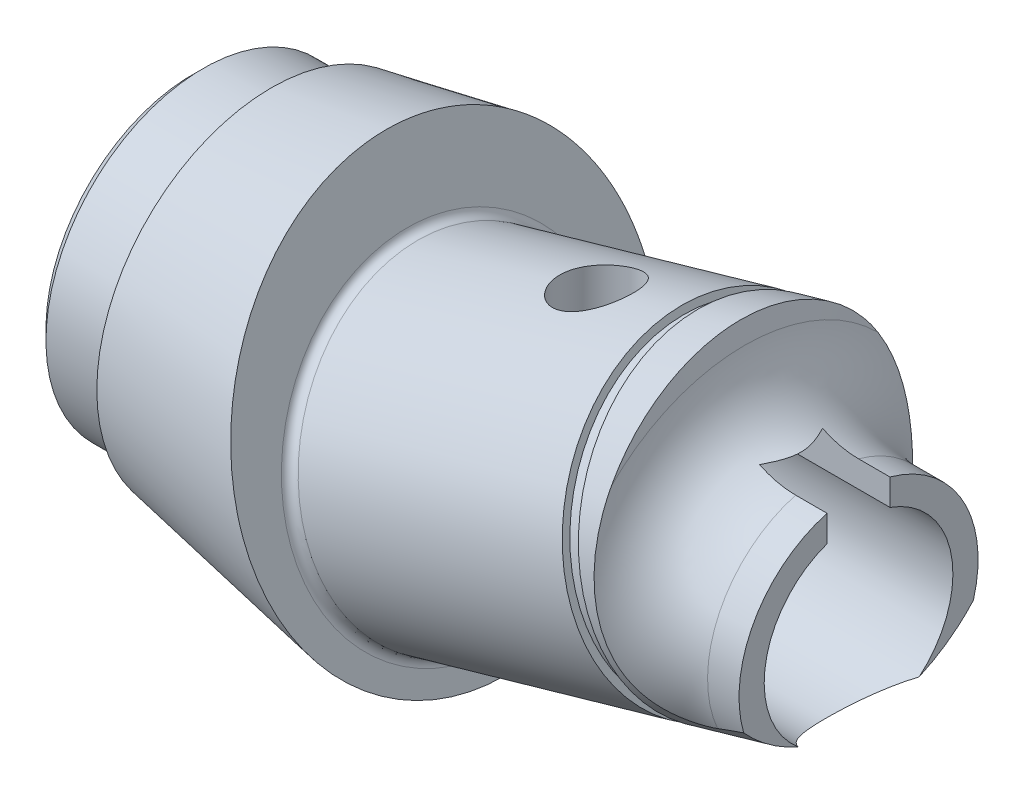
ISO-10303-21;
HEADER;
FILE_DESCRIPTION(('STEP AP214'),'2;1');
FILE_NAME('part.step','',(''),(''),'','','');
FILE_SCHEMA(('AUTOMOTIVE_DESIGN { 1 0 10303 214 1 1 1 1 }'));
ENDSEC;
DATA;
#1=APPLICATION_CONTEXT('core data for automotive mechanical design processes');
#2=APPLICATION_PROTOCOL_DEFINITION('international standard','automotive_design',2000,#1);
#3=PRODUCT_CONTEXT('',#1,'mechanical');
#4=PRODUCT('Part','Part','',(#3));
#5=PRODUCT_RELATED_PRODUCT_CATEGORY('part','',(#4));
#6=PRODUCT_DEFINITION_FORMATION('','',#4);
#7=PRODUCT_DEFINITION_CONTEXT('part definition',#1,'design');
#8=PRODUCT_DEFINITION('design','',#6,#7);
#9=PRODUCT_DEFINITION_SHAPE('','',#8);
#10=(LENGTH_UNIT() NAMED_UNIT(*) SI_UNIT(.MILLI.,.METRE.));
#11=(NAMED_UNIT(*) PLANE_ANGLE_UNIT() SI_UNIT($,.RADIAN.));
#12=(NAMED_UNIT(*) SI_UNIT($,.STERADIAN.) SOLID_ANGLE_UNIT());
#13=UNCERTAINTY_MEASURE_WITH_UNIT(LENGTH_MEASURE(1.E-05),#10,'distance_accuracy_value','');
#14=(GEOMETRIC_REPRESENTATION_CONTEXT(3) GLOBAL_UNCERTAINTY_ASSIGNED_CONTEXT((#13)) GLOBAL_UNIT_ASSIGNED_CONTEXT((#10,
#11,#12)) REPRESENTATION_CONTEXT('',''));
#15=CARTESIAN_POINT('',(0.,0.,0.));
#16=DIRECTION('',(0.,0.,1.));
#17=DIRECTION('',(1.,0.,0.));
#18=AXIS2_PLACEMENT_3D('',#15,#16,#17);
#19=CARTESIAN_POINT('',(101.964912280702,0.,0.));
#20=DIRECTION('',(1.,0.,0.));
#21=DIRECTION('',(0.,1.,0.));
#22=AXIS2_PLACEMENT_3D('',#19,#20,#21);
#23=CYLINDRICAL_SURFACE('',#22,11.4);
#24=DIRECTION('',(1.,0.,0.));
#25=VECTOR('',#24,1.);
#26=CARTESIAN_POINT('',(101.964912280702,10.998181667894,3.));
#27=LINE('',#26,#25);
#28=CARTESIAN_POINT('',(63.5,10.998181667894,2.99999999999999));
#29=VERTEX_POINT('',#28);
#30=CARTESIAN_POINT('',(60.5,10.998181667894,2.99999999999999));
#31=VERTEX_POINT('',#30);
#32=EDGE_CURVE('E143',#29,#31,#27,.F.);
#33=ORIENTED_EDGE('',*,*,#32,.T.);
#34=CARTESIAN_POINT('',(60.5,0.,0.));
#35=DIRECTION('',(1.,0.,0.));
#36=DIRECTION('',(0.,1.,0.));
#37=AXIS2_PLACEMENT_3D('',#34,#35,#36);
#38=CIRCLE('',#37,11.4);
#39=CARTESIAN_POINT('',(60.4999999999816,-4.55161062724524,10.4519299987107));
#40=VERTEX_POINT('',#39);
#41=EDGE_CURVE('E230',#31,#40,#38,.T.);
#42=ORIENTED_EDGE('',*,*,#41,.T.);
#43=CARTESIAN_POINT('',(86.3,3.32401617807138,10.9046282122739));
#44=CARTESIAN_POINT('',(85.8472685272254,3.22682422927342,10.9342519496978));
#45=CARTESIAN_POINT('',(85.3946631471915,3.12870484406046,10.9627446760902));
#46=CARTESIAN_POINT('',(84.4897524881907,2.93043661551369,11.0174010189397));
#47=CARTESIAN_POINT('',(84.0374472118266,2.83028775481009,11.0435646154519));
#48=CARTESIAN_POINT('',(82.6809180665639,2.52650468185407,11.1184684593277));
#49=CARTESIAN_POINT('',(81.7772280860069,2.31956546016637,11.163612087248));
#50=CARTESIAN_POINT('',(79.9657845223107,1.89373932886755,11.2437095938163));
#51=CARTESIAN_POINT('',(79.0580444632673,1.67478145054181,11.2785929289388));
#52=CARTESIAN_POINT('',(77.2454235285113,1.22399059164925,11.336382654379));
#53=CARTESIAN_POINT('',(76.3405424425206,0.992158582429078,11.3592899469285));
#54=CARTESIAN_POINT('',(74.9636881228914,0.626607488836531,11.3834615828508));
#55=CARTESIAN_POINT('',(74.4902833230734,0.498602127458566,11.3898378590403));
#56=CARTESIAN_POINT('',(73.5447801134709,0.237726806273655,11.3982691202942));
#57=CARTESIAN_POINT('',(73.0726816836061,0.104856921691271,11.4003241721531));
#58=CARTESIAN_POINT('',(72.129934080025,-0.166361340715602,11.3995928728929));
#59=CARTESIAN_POINT('',(71.6592852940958,-0.304711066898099,11.3968053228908));
#60=CARTESIAN_POINT('',(70.7198917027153,-0.587527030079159,11.3857298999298));
#61=CARTESIAN_POINT('',(70.2511468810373,-0.731993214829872,11.3774420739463));
#62=CARTESIAN_POINT('',(69.3173050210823,-1.02739185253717,11.3545742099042));
#63=CARTESIAN_POINT('',(68.8522014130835,-1.17830484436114,11.3400120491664));
#64=CARTESIAN_POINT('',(67.9248261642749,-1.48785324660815,11.303565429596));
#65=CARTESIAN_POINT('',(67.4625546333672,-1.64648895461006,11.2816806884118));
#66=CARTESIAN_POINT('',(66.5417839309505,-1.97238607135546,11.2292887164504));
#67=CARTESIAN_POINT('',(66.0832830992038,-2.13964341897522,11.1987855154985));
#68=CARTESIAN_POINT('',(65.1707993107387,-2.4839360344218,11.1274885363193));
#69=CARTESIAN_POINT('',(64.7168157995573,-2.66097008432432,11.0866960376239));
#70=CARTESIAN_POINT('',(64.0220560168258,-2.9420735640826,11.014287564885));
#71=CARTESIAN_POINT('',(63.7792421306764,-3.04225739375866,10.9870785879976));
#72=CARTESIAN_POINT('',(63.2955309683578,-3.24602525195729,10.9286121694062));
#73=CARTESIAN_POINT('',(63.0546336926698,-3.34960928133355,10.8973547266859));
#74=CARTESIAN_POINT('',(62.574967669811,-3.56040339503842,10.8303171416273));
#75=CARTESIAN_POINT('',(62.3361995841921,-3.66761455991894,10.7945356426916));
#76=CARTESIAN_POINT('',(61.8612244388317,-3.88580772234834,10.7179214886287));
#77=CARTESIAN_POINT('',(61.6250173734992,-3.99678971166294,10.6770888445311));
#78=CARTESIAN_POINT('',(60.9230255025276,-4.33459602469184,10.5465446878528));
#79=CARTESIAN_POINT('',(60.4615091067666,-4.56731168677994,10.4484690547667));
#80=CARTESIAN_POINT('',(59.7811136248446,-4.92871631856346,10.2803353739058));
#81=CARTESIAN_POINT('',(59.5563122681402,-5.05122955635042,10.2207929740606));
#82=CARTESIAN_POINT('',(59.1112751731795,-5.30038584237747,10.0938337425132));
#83=CARTESIAN_POINT('',(58.8910391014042,-5.4270285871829,10.0264174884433));
#84=CARTESIAN_POINT('',(58.3692091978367,-5.73560332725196,9.85420402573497));
#85=CARTESIAN_POINT('',(58.0701226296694,-5.91947905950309,9.74520844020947));
#86=CARTESIAN_POINT('',(57.4845959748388,-6.29447316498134,9.50730752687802));
#87=CARTESIAN_POINT('',(57.1981558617,-6.48559152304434,9.37840224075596));
#88=CARTESIAN_POINT('',(56.6410618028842,-6.87332278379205,9.09805328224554));
#89=CARTESIAN_POINT('',(56.370384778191,-7.06992699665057,8.94664377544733));
#90=CARTESIAN_POINT('',(55.8474059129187,-7.4664486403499,8.61848598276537));
#91=CARTESIAN_POINT('',(55.5950988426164,-7.66636510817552,8.44174495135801));
#92=CARTESIAN_POINT('',(55.1650814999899,-8.02196967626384,8.10273603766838));
#93=CARTESIAN_POINT('',(54.9831731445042,-8.17771019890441,7.94584102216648));
#94=CARTESIAN_POINT('',(54.6337406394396,-8.48687316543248,7.61473934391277));
#95=CARTESIAN_POINT('',(54.4662130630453,-8.6402961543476,7.44053682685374));
#96=CARTESIAN_POINT('',(54.1466513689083,-8.94239808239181,7.07458850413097));
#97=CARTESIAN_POINT('',(53.9946190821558,-9.09107645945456,6.88284063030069));
#98=CARTESIAN_POINT('',(53.7069479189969,-9.38098803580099,6.48214471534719));
#99=CARTESIAN_POINT('',(53.57130931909,-9.52222110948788,6.27319638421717));
#100=CARTESIAN_POINT('',(53.316333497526,-9.79519741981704,5.83784580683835));
#101=CARTESIAN_POINT('',(53.1970832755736,-9.92688837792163,5.61135969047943));
#102=CARTESIAN_POINT('',(52.9759392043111,-10.1773097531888,5.14323084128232));
#103=CARTESIAN_POINT('',(52.8740457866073,-10.2960398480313,4.90158773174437));
#104=CARTESIAN_POINT('',(52.6875637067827,-10.5181202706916,4.40490132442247));
#105=CARTESIAN_POINT('',(52.6029761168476,-10.6214696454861,4.14985719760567));
#106=CARTESIAN_POINT('',(52.4508704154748,-10.8106981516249,3.6284577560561));
#107=CARTESIAN_POINT('',(52.383351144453,-10.8965784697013,3.36210321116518));
#108=CARTESIAN_POINT('',(52.2701391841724,-11.0426109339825,2.84374505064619));
#109=CARTESIAN_POINT('',(52.2230661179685,-11.1043433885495,2.59248545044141));
#110=CARTESIAN_POINT('',(52.142607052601,-11.2108551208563,2.08425652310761));
#111=CARTESIAN_POINT('',(52.1092201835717,-11.2556354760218,1.82728755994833));
#112=CARTESIAN_POINT('',(52.0559066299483,-11.3275508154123,1.30954156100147));
#113=CARTESIAN_POINT('',(52.0359786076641,-11.3546875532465,1.04876490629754));
#114=CARTESIAN_POINT('',(52.0094264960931,-11.3909135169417,0.525284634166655));
#115=CARTESIAN_POINT('',(52.0028025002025,-11.4000026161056,0.262581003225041));
#116=CARTESIAN_POINT('',(52.0028065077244,-11.3999974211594,-0.25895303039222));
#117=CARTESIAN_POINT('',(52.0092407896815,-11.3911689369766,-0.517783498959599));
#118=CARTESIAN_POINT('',(52.0350230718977,-11.355989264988,-1.03360095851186));
#119=CARTESIAN_POINT('',(52.0543708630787,-11.3296383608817,-1.29058797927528));
#120=CARTESIAN_POINT('',(52.1061177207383,-11.2598058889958,-1.80085318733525));
#121=CARTESIAN_POINT('',(52.1385147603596,-11.2163269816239,-2.05413194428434));
#122=CARTESIAN_POINT('',(52.2165752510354,-11.1128885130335,-2.55522108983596));
#123=CARTESIAN_POINT('',(52.2622387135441,-11.0529289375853,-2.80303147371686));
#124=CARTESIAN_POINT('',(52.3670808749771,-10.9174596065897,-3.29139444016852));
#125=CARTESIAN_POINT('',(52.4262574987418,-10.8419522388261,-3.5319481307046));
#126=CARTESIAN_POINT('',(52.5583840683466,-10.676574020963,-4.00416675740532));
#127=CARTESIAN_POINT('',(52.6313338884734,-10.5867033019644,-4.23583177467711));
#128=CARTESIAN_POINT('',(52.7912011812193,-10.394059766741,-4.6887175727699));
#129=CARTESIAN_POINT('',(52.8781176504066,-10.291287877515,-4.90993910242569));
#130=CARTESIAN_POINT('',(53.0660089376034,-10.0745291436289,-5.34059732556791));
#131=CARTESIAN_POINT('',(53.1669838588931,-9.96054221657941,-5.55003393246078));
#132=CARTESIAN_POINT('',(53.3838680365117,-9.72218537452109,-5.9577998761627));
#133=CARTESIAN_POINT('',(53.4999014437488,-9.59773256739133,-6.15601463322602));
#134=CARTESIAN_POINT('',(53.7458965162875,-9.34138451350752,-6.53846622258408));
#135=CARTESIAN_POINT('',(53.8758578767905,-9.20948942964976,-6.72270336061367));
#136=CARTESIAN_POINT('',(54.1491504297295,-8.94036798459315,-7.0766689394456));
#137=CARTESIAN_POINT('',(54.292477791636,-8.80314315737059,-7.2464015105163));
#138=CARTESIAN_POINT('',(54.5918044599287,-8.52530454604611,-7.57132099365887));
#139=CARTESIAN_POINT('',(54.7478063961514,-8.38469006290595,-7.72650487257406));
#140=CARTESIAN_POINT('',(55.1317981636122,-8.04931242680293,-8.07758812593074));
#141=CARTESIAN_POINT('',(55.364984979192,-7.85385828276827,-8.26716829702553));
#142=CARTESIAN_POINT('',(55.850785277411,-7.46400697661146,-8.62078610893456));
#143=CARTESIAN_POINT('',(56.1034054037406,-7.26961020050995,-8.78481495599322));
#144=CARTESIAN_POINT('',(56.6256246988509,-6.88451448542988,-9.08976908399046));
#145=CARTESIAN_POINT('',(56.89525305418,-6.69382268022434,-9.23065306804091));
#146=CARTESIAN_POINT('',(57.4483523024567,-6.31845721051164,-9.4915415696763));
#147=CARTESIAN_POINT('',(57.7318233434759,-6.1337836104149,-9.61154586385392));
#148=CARTESIAN_POINT('',(58.2704514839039,-5.79645375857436,-9.81807825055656));
#149=CARTESIAN_POINT('',(58.5241536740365,-5.64288233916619,-9.90694037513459));
#150=CARTESIAN_POINT('',(59.0387478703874,-5.34136758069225,-10.0727056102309));
#151=CARTESIAN_POINT('',(59.2996411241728,-5.19342522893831,-10.1496066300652));
#152=CARTESIAN_POINT('',(59.8275844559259,-4.90320562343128,-10.2929481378));
#153=CARTESIAN_POINT('',(60.0946383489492,-4.76093203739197,-10.3593819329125));
#154=CARTESIAN_POINT('',(60.6337954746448,-4.48205833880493,-10.4830538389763));
#155=CARTESIAN_POINT('',(60.9058990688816,-4.34545863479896,-10.5402912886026));
#156=CARTESIAN_POINT('',(61.4567451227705,-4.076572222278,-10.6471908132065));
#157=CARTESIAN_POINT('',(61.7355249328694,-3.94433404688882,-10.6967817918));
#158=CARTESIAN_POINT('',(62.2967037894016,-3.68517591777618,-10.7888082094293));
#159=CARTESIAN_POINT('',(62.5791028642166,-3.55825600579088,-10.8312435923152));
#160=CARTESIAN_POINT('',(63.1468209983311,-3.30948796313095,-10.9098256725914));
#161=CARTESIAN_POINT('',(63.4321386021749,-3.18763744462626,-10.9459753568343));
#162=CARTESIAN_POINT('',(64.0053610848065,-2.94862550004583,-11.0127649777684));
#163=CARTESIAN_POINT('',(64.2932659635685,-2.8314640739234,-11.0434049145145));
#164=CARTESIAN_POINT('',(65.0311968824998,-2.53788639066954,-11.1154399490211));
#165=CARTESIAN_POINT('',(65.4827857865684,-2.36455203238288,-11.1534058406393));
#166=CARTESIAN_POINT('',(66.3901792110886,-2.02725626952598,-11.2196140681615));
#167=CARTESIAN_POINT('',(66.8459841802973,-1.86329587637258,-11.2478553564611));
#168=CARTESIAN_POINT('',(67.7611135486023,-1.54364823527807,-11.2961622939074));
#169=CARTESIAN_POINT('',(68.2204393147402,-1.3879644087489,-11.3162245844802));
#170=CARTESIAN_POINT('',(69.141758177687,-1.08401007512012,-11.3493736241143));
#171=CARTESIAN_POINT('',(69.6037511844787,-0.935739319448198,-11.3624606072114));
#172=CARTESIAN_POINT('',(70.5311126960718,-0.6454034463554,-11.3826484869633));
#173=CARTESIAN_POINT('',(70.9964868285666,-0.503355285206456,-11.3897338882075));
#174=CARTESIAN_POINT('',(71.929045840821,-0.225144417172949,-11.3986247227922));
#175=CARTESIAN_POINT('',(72.3962307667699,-0.0889818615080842,-11.4004300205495));
#176=CARTESIAN_POINT('',(73.7997962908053,0.311592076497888,-11.3988788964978));
#177=CARTESIAN_POINT('',(74.7384145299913,0.568160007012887,-11.3885597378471));
#178=CARTESIAN_POINT('',(76.5618763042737,1.04925380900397,-11.35400453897));
#179=CARTESIAN_POINT('',(77.446476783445,1.27477986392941,-11.3306634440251));
#180=CARTESIAN_POINT('',(79.2183648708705,1.71368536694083,-11.2726344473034));
#181=CARTESIAN_POINT('',(80.1056526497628,1.92706402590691,-11.2379458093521));
#182=CARTESIAN_POINT('',(81.8767682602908,2.3424585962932,-11.158732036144));
#183=CARTESIAN_POINT('',(82.7605845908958,2.54453538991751,-11.1142676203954));
#184=CARTESIAN_POINT('',(84.0872607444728,2.8413382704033,-11.0407047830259));
#185=CARTESIAN_POINT('',(84.5296128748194,2.93921369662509,-11.015041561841));
#186=CARTESIAN_POINT('',(85.414603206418,3.13302719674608,-10.9614888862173));
#187=CARTESIAN_POINT('',(85.8572414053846,3.22896528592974,-10.9335994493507));
#188=CARTESIAN_POINT('',(86.3,3.32401617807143,-10.904628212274));
#189=B_SPLINE_CURVE_WITH_KNOTS('',3,(#43,#44,#45,#46,#47,#48,#49,#50,#51,#52,#53,#54,#55,#56,
#57,#58,#59,#60,#61,#62,#63,#64,#65,#66,#67,#68,#69,#70,#71,#72,#73,#74,#75,#76,#77,#78,#79,#80,
#81,#82,#83,#84,#85,#86,#87,#88,#89,#90,#91,#92,#93,#94,#95,#96,#97,#98,#99,#100,#101,#102,#103,
#104,#105,#106,#107,#108,#109,#110,#111,#112,#113,#114,#115,#116,#117,#118,#119,#120,#121,#122,
#123,#124,#125,#126,#127,#128,#129,#130,#131,#132,#133,#134,#135,#136,#137,#138,#139,#140,#141,
#142,#143,#144,#145,#146,#147,#148,#149,#150,#151,#152,#153,#154,#155,#156,#157,#158,#159,#160,
#161,#162,#163,#164,#165,#166,#167,#168,#169,#170,#171,#172,#173,#174,#175,#176,#177,#178,#179,
#180,#181,#182,#183,#184,#185,#186,#187,#188),.UNSPECIFIED.,.F.,.F.,(4,2,2,2,2,2,2,2,2,2,2,2,2,
2,2,2,2,2,2,2,2,2,2,2,2,2,2,2,2,2,2,2,2,2,2,2,2,2,2,2,2,2,2,2,2,2,2,2,2,2,2,2,2,2,2,2,2,2,2,2,2,
2,2,2,2,2,2,2,2,2,2,2,4),(0.,1.39197449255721,2.78396090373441,5.56838621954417,
8.37153055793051,11.1744636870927,12.6457680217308,14.1170496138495,15.5886955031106,
17.0603288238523,18.5277964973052,19.9953207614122,21.4621599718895,22.9288168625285,
23.7209923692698,24.5131680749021,25.3055818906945,26.0979939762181,27.6750398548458,
28.4634382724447,29.2517788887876,30.3538906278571,31.4560000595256,32.5564530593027,
33.6565915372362,34.5146527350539,35.3725088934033,36.2304663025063,37.088438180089,
37.9508019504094,38.8131871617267,39.6756257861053,40.538005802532,41.3259958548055,
42.1139358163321,42.9017974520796,43.6896646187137,44.4659291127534,45.242181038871,
46.0183124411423,46.794444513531,47.5704574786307,48.3464633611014,49.1224135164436,
49.8983693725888,50.6811859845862,51.4639854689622,52.2465612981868,53.0292999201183,
54.1031167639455,55.1773023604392,56.2533842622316,57.3294776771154,58.2578534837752,
59.1863913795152,60.1155205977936,61.0447166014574,61.9820895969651,62.9194699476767,
63.8564036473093,64.7933373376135,66.2486723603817,67.7041641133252,69.1602529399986,
70.6162929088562,72.0760808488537,73.535906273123,76.4548447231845,79.1942631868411,
81.9338594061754,84.6568973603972,86.0182204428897,87.3795327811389),.UNSPECIFIED.);
#190=CARTESIAN_POINT('',(63.5000000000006,-3.15990757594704,10.9533092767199));
#191=VERTEX_POINT('',#190);
#192=EDGE_CURVE('E203',#191,#40,#189,.T.);
#193=ORIENTED_EDGE('',*,*,#192,.F.);
#194=CARTESIAN_POINT('',(63.5,0.,0.));
#195=DIRECTION('',(1.,0.,0.));
#196=DIRECTION('',(0.,1.,0.));
#197=AXIS2_PLACEMENT_3D('',#194,#195,#196);
#198=CIRCLE('',#197,11.4);
#199=EDGE_CURVE('E149',#29,#191,#198,.T.);
#200=ORIENTED_EDGE('',*,*,#199,.F.);
#201=EDGE_LOOP('',(#33,#42,#193,#200));
#202=FACE_BOUND('',#201,.T.);
#203=ADVANCED_FACE('F38',(#202),#23,.T.);
#204=CARTESIAN_POINT('',(63.5,11.4,0.));
#205=DIRECTION('',(1.,0.,0.));
#206=DIRECTION('',(0.,1.,0.));
#207=AXIS2_PLACEMENT_3D('',#204,#205,#206);
#208=PLANE('',#207);
#209=DIRECTION('',(0.,-1.,0.));
#210=VECTOR('',#209,1.);
#211=CARTESIAN_POINT('',(63.5,11.8,3.));
#212=LINE('',#211,#210);
#213=CARTESIAN_POINT('',(63.5,8.48528137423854,3.));
#214=VERTEX_POINT('',#213);
#215=EDGE_CURVE('E131',#29,#214,#212,.T.);
#216=ORIENTED_EDGE('',*,*,#215,.F.);
#217=ORIENTED_EDGE('',*,*,#199,.T.);
#218=CARTESIAN_POINT('',(63.5,7.50125929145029,0.));
#219=DIRECTION('',(1.,0.,0.));
#220=DIRECTION('',(0.,1.,0.));
#221=AXIS2_PLACEMENT_3D('',#218,#219,#220);
#222=ELLIPSE('',#221,15.604491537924,15.);
#223=CARTESIAN_POINT('',(63.5,-6.89772597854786,5.78112241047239));
#224=VERTEX_POINT('',#223);
#225=EDGE_CURVE('E246',#224,#191,#222,.F.);
#226=ORIENTED_EDGE('',*,*,#225,.F.);
#227=CARTESIAN_POINT('',(63.5,0.,0.));
#228=DIRECTION('',(1.,0.,0.));
#229=DIRECTION('',(0.,1.,0.));
#230=AXIS2_PLACEMENT_3D('',#227,#228,#229);
#231=CIRCLE('',#230,9.);
#232=EDGE_CURVE('E151',#214,#224,#231,.T.);
#233=ORIENTED_EDGE('',*,*,#232,.F.);
#234=EDGE_LOOP('',(#216,#217,#226,#233));
#235=FACE_BOUND('',#234,.T.);
#236=ADVANCED_FACE('F219',(#235),#208,.T.);
#237=CARTESIAN_POINT('',(0.,0.,0.));
#238=DIRECTION('',(1.,0.,0.));
#239=DIRECTION('',(0.,1.,0.));
#240=AXIS2_PLACEMENT_3D('',#237,#238,#239);
#241=CYLINDRICAL_SURFACE('',#240,9.);
#242=CARTESIAN_POINT('',(9.99999999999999,0.,0.));
#243=DIRECTION('',(-1.,0.,0.));
#244=DIRECTION('',(0.,-1.,0.));
#245=AXIS2_PLACEMENT_3D('',#242,#243,#244);
#246=CIRCLE('',#245,9.);
#247=CARTESIAN_POINT('',(9.99999999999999,-9.,0.));
#248=VERTEX_POINT('',#247);
#249=EDGE_CURVE('E312',#248,#248,#246,.F.);
#250=ORIENTED_EDGE('',*,*,#249,.F.);
#251=EDGE_LOOP('',(#250));
#252=FACE_BOUND('',#251,.T.);
#253=CARTESIAN_POINT('',(35.,8.99999999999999,0.));
#254=CARTESIAN_POINT('',(35.000000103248,9.00000002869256,-0.094496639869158));
#255=CARTESIAN_POINT('',(35.0038323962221,8.99850705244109,-0.188987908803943));
#256=CARTESIAN_POINT('',(35.0191085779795,8.99258387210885,-0.377269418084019));
#257=CARTESIAN_POINT('',(35.0305549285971,8.98815271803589,-0.471059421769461));
#258=CARTESIAN_POINT('',(35.076166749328,8.97060600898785,-0.750206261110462));
#259=CARTESIAN_POINT('',(35.1216053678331,8.95323676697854,-0.933593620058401));
#260=CARTESIAN_POINT('',(35.2406742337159,8.90899522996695,-1.28916766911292));
#261=CARTESIAN_POINT('',(35.3142476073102,8.88214211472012,-1.4613761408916));
#262=CARTESIAN_POINT('',(35.4872062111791,8.82158559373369,-1.79101147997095));
#263=CARTESIAN_POINT('',(35.5865988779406,8.78788021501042,-1.94843407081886));
#264=CARTESIAN_POINT('',(35.8130508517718,8.71537394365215,-2.25110573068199));
#265=CARTESIAN_POINT('',(35.9410716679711,8.67642148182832,-2.39559841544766));
#266=CARTESIAN_POINT('',(36.2191052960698,8.59852821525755,-2.66168474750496));
#267=CARTESIAN_POINT('',(36.3691255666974,8.55958741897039,-2.78327059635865));
#268=CARTESIAN_POINT('',(36.6944983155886,8.48432701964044,-3.00508028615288));
#269=CARTESIAN_POINT('',(36.8706450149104,8.44818385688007,-3.10420500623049));
#270=CARTESIAN_POINT('',(37.2387326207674,8.38498867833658,-3.27108340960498));
#271=CARTESIAN_POINT('',(37.4306666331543,8.35793272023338,-3.33885070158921));
#272=CARTESIAN_POINT('',(37.8161536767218,8.31760514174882,-3.43805418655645));
#273=CARTESIAN_POINT('',(38.0092741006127,8.30378572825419,-3.47094087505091));
#274=CARTESIAN_POINT('',(38.3987490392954,8.28990091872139,-3.50398302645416));
#275=CARTESIAN_POINT('',(38.5951020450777,8.28982927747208,-3.50415335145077));
#276=CARTESIAN_POINT('',(38.9718391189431,8.30297860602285,-3.47286138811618));
#277=CARTESIAN_POINT('',(39.1524302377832,8.31533400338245,-3.44345891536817));
#278=CARTESIAN_POINT('',(39.5058781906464,8.35049891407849,-3.35727730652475));
#279=CARTESIAN_POINT('',(39.6787337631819,8.37331012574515,-3.30049372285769));
#280=CARTESIAN_POINT('',(40.0158340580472,8.42730543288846,-3.16010358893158));
#281=CARTESIAN_POINT('',(40.1798409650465,8.4586461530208,-3.0759889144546));
#282=CARTESIAN_POINT('',(40.4919909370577,8.52612200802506,-2.88367974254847));
#283=CARTESIAN_POINT('',(40.6401282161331,8.56225888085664,-2.77547650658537));
#284=CARTESIAN_POINT('',(40.9276671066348,8.6384578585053,-2.52880675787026));
#285=CARTESIAN_POINT('',(41.0656503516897,8.67861431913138,-2.38871182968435));
#286=CARTESIAN_POINT('',(41.3166039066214,8.75608272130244,-2.08692657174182));
#287=CARTESIAN_POINT('',(41.4295697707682,8.79339415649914,-1.92523241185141));
#288=CARTESIAN_POINT('',(41.629006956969,8.86181324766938,-1.58099910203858));
#289=CARTESIAN_POINT('',(41.7149723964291,8.89279902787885,-1.39814089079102));
#290=CARTESIAN_POINT('',(41.8544407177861,8.94416228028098,-1.01904991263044));
#291=CARTESIAN_POINT('',(41.9079591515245,8.96454483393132,-0.822823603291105));
#292=CARTESIAN_POINT('',(41.9782099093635,8.99149370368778,-0.434477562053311));
#293=CARTESIAN_POINT('',(41.996850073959,8.9987756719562,-0.242752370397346));
#294=CARTESIAN_POINT('',(42.0024133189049,9.00093788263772,0.141204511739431));
#295=CARTESIAN_POINT('',(41.9893440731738,8.99582112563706,0.33343606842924));
#296=CARTESIAN_POINT('',(41.9332843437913,8.97423120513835,0.704484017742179));
#297=CARTESIAN_POINT('',(41.8915723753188,8.95824356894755,0.883524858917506));
#298=CARTESIAN_POINT('',(41.7811254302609,8.91701575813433,1.23191930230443));
#299=CARTESIAN_POINT('',(41.712386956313,8.8917743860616,1.40127164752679));
#300=CARTESIAN_POINT('',(41.5476119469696,8.83356289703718,1.73121046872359));
#301=CARTESIAN_POINT('',(41.4508155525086,8.80038288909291,1.89137927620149));
#302=CARTESIAN_POINT('',(41.2335221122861,8.72992500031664,2.1937529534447));
#303=CARTESIAN_POINT('',(41.1130158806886,8.69264553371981,2.33595082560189));
#304=CARTESIAN_POINT('',(40.8428864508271,8.61518244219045,2.60764760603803));
#305=CARTESIAN_POINT('',(40.6919151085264,8.57496281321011,2.73579940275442));
#306=CARTESIAN_POINT('',(40.3698604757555,8.49835030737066,2.96525129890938));
#307=CARTESIAN_POINT('',(40.1987745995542,8.46195792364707,3.0665479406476));
#308=CARTESIAN_POINT('',(39.8393206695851,8.39716489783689,3.23979638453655));
#309=CARTESIAN_POINT('',(39.6508394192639,8.36882232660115,3.31153655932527));
#310=CARTESIAN_POINT('',(39.2630473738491,8.32437875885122,3.4217417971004));
#311=CARTESIAN_POINT('',(39.0637440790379,8.30826939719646,3.46022960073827));
#312=CARTESIAN_POINT('',(38.6746838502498,8.29128149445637,3.50072682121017));
#313=CARTESIAN_POINT('',(38.4852088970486,8.289434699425,3.50505568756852));
#314=CARTESIAN_POINT('',(38.1083755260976,8.29866867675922,3.48313623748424));
#315=CARTESIAN_POINT('',(37.9210168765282,8.30974801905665,3.45689130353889));
#316=CARTESIAN_POINT('',(37.5604879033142,8.3427530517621,3.37642517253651));
#317=CARTESIAN_POINT('',(37.3870501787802,8.3642818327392,3.32322482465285));
#318=CARTESIAN_POINT('',(37.0514781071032,8.41550175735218,3.19128687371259));
#319=CARTESIAN_POINT('',(36.889346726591,8.44519503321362,3.11254259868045));
#320=CARTESIAN_POINT('',(36.571255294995,8.51143389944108,2.9267255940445));
#321=CARTESIAN_POINT('',(36.416128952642,8.54826711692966,2.81832986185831));
#322=CARTESIAN_POINT('',(36.1255288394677,8.62371049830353,2.5782602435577));
#323=CARTESIAN_POINT('',(35.9900615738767,8.66232124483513,2.44657868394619));
#324=CARTESIAN_POINT('',(35.734329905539,8.73974739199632,2.15429983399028));
#325=CARTESIAN_POINT('',(35.6154634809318,8.77843633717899,1.99244243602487));
#326=CARTESIAN_POINT('',(35.4065817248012,8.84926752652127,1.64954279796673));
#327=CARTESIAN_POINT('',(35.3165724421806,8.88140839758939,1.46849654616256));
#328=CARTESIAN_POINT('',(35.2028988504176,8.92297823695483,1.17940095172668));
#329=CARTESIAN_POINT('',(35.1677884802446,8.93604258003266,1.07623309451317));
#330=CARTESIAN_POINT('',(35.1072690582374,8.95878491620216,0.86674114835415));
#331=CARTESIAN_POINT('',(35.0818556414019,8.96846443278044,0.760418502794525));
#332=CARTESIAN_POINT('',(35.0410632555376,8.9840909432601,0.545627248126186));
#333=CARTESIAN_POINT('',(35.0256818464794,8.99003884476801,0.437159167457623));
#334=CARTESIAN_POINT('',(35.0051509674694,8.99799304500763,0.219124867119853));
#335=CARTESIAN_POINT('',(34.9999998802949,8.99999996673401,0.109558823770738));
#336=CARTESIAN_POINT('',(35.,8.99999999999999,0.));
#337=B_SPLINE_CURVE_WITH_KNOTS('',3,(#253,#254,#255,#256,#257,#258,#259,#260,#261,#262,#263,
#264,#265,#266,#267,#268,#269,#270,#271,#272,#273,#274,#275,#276,#277,#278,#279,#280,#281,#282,
#283,#284,#285,#286,#287,#288,#289,#290,#291,#292,#293,#294,#295,#296,#297,#298,#299,#300,#301,
#302,#303,#304,#305,#306,#307,#308,#309,#310,#311,#312,#313,#314,#315,#316,#317,#318,#319,#320,
#321,#322,#323,#324,#325,#326,#327,#328,#329,#330,#331,#332,#333,#334,#335,#336),.UNSPECIFIED.,
.T.,.F.,(4,2,2,2,2,2,2,2,2,2,2,2,2,2,2,2,2,2,2,2,2,2,2,2,2,2,2,2,2,2,2,2,2,2,2,2,2,2,2,2,2,4),
(0.,0.283380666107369,0.566853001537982,1.13304671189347,1.6981018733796,2.26331996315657,
2.85154588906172,3.43997171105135,4.05287697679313,4.66551600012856,5.25153893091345,
5.83729564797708,6.38489636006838,6.93258605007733,7.49110419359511,8.04982528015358,
8.64917156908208,9.2486242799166,9.85871753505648,10.4685181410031,11.0438596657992,
11.6190619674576,12.1701285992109,12.7212665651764,13.2890048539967,13.8569635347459,
14.4603817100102,15.0638775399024,15.671622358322,16.2789512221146,16.8446532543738,
17.4102927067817,17.9559540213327,18.5017579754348,19.0776683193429,19.6537688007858,
20.2644009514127,20.8751610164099,21.2039909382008,21.5326726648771,21.8612744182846,
22.1898242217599),.UNSPECIFIED.);
#338=CARTESIAN_POINT('',(40.302775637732,8.48528137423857,2.99999999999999));
#339=VERTEX_POINT('',#338);
#340=CARTESIAN_POINT('',(40.302775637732,8.48528137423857,-3.00000000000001));
#341=VERTEX_POINT('',#340);
#342=EDGE_CURVE('E277',#339,#341,#337,.T.);
#343=ORIENTED_EDGE('',*,*,#342,.F.);
#344=DIRECTION('',(1.,0.,0.));
#345=VECTOR('',#344,1.);
#346=CARTESIAN_POINT('',(0.,8.48528137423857,3.));
#347=LINE('',#346,#345);
#348=EDGE_CURVE('E142',#214,#339,#347,.F.);
#349=ORIENTED_EDGE('',*,*,#348,.F.);
#350=ORIENTED_EDGE('',*,*,#232,.T.);
#351=CARTESIAN_POINT('',(63.5,-6.89772597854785,-5.7811224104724));
#352=CARTESIAN_POINT('',(63.3344558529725,-6.9962732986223,-5.66350422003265));
#353=CARTESIAN_POINT('',(63.1725128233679,-7.09443384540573,-5.54030710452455));
#354=CARTESIAN_POINT('',(62.8569169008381,-7.28896521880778,-5.28179213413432));
#355=CARTESIAN_POINT('',(62.7032788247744,-7.38533265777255,-5.14645369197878));
#356=CARTESIAN_POINT('',(62.4045313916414,-7.57582525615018,-4.86173072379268));
#357=CARTESIAN_POINT('',(62.2595183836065,-7.66991989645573,-4.71222351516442));
#358=CARTESIAN_POINT('',(61.9814383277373,-7.85321761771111,-4.39997718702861));
#359=CARTESIAN_POINT('',(61.8483634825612,-7.94242387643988,-4.23724683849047));
#360=CARTESIAN_POINT('',(61.5182549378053,-8.16699022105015,-3.79395072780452));
#361=CARTESIAN_POINT('',(61.3320109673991,-8.29712732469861,-3.50229355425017));
#362=CARTESIAN_POINT('',(61.0857663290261,-8.47243172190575,-3.04056224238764));
#363=CARTESIAN_POINT('',(61.0092716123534,-8.52749951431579,-2.88279939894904));
#364=CARTESIAN_POINT('',(60.8681065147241,-8.6299793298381,-2.55971102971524));
#365=CARTESIAN_POINT('',(60.8034300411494,-8.6773952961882,-2.39438945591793));
#366=CARTESIAN_POINT('',(60.6862118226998,-8.76392467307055,-2.0553702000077));
#367=CARTESIAN_POINT('',(60.6338010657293,-8.80294813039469,-1.88160410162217));
#368=CARTESIAN_POINT('',(60.5427883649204,-8.87106503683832,-1.52856577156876));
#369=CARTESIAN_POINT('',(60.5041868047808,-8.90015821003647,-1.34929338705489));
#370=CARTESIAN_POINT('',(60.4414381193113,-8.94760565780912,-0.986798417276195));
#371=CARTESIAN_POINT('',(60.4172932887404,-8.96595822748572,-0.803575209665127));
#372=CARTESIAN_POINT('',(60.3838931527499,-8.99137748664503,-0.435010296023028));
#373=CARTESIAN_POINT('',(60.374635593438,-8.99844588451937,-0.249668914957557));
#374=CARTESIAN_POINT('',(60.3714109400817,-9.00090693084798,0.0947852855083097));
#375=CARTESIAN_POINT('',(60.3754537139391,-8.99781925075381,0.253873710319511));
#376=CARTESIAN_POINT('',(60.3945434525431,-8.98327019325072,0.571003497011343));
#377=CARTESIAN_POINT('',(60.40959007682,-8.97180907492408,0.729044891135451));
#378=CARTESIAN_POINT('',(60.4504845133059,-8.94076811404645,1.04284067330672));
#379=CARTESIAN_POINT('',(60.4763277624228,-8.92119170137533,1.19859599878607));
#380=CARTESIAN_POINT('',(60.5384875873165,-8.87433404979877,1.50681769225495));
#381=CARTESIAN_POINT('',(60.5748044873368,-8.84705257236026,1.6592839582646));
#382=CARTESIAN_POINT('',(60.656718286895,-8.7858963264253,1.95722281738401));
#383=CARTESIAN_POINT('',(60.702132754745,-8.7521516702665,2.10277239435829));
#384=CARTESIAN_POINT('',(60.8021259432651,-8.67838132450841,2.3890556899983));
#385=CARTESIAN_POINT('',(60.8567073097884,-8.63835382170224,2.5297880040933));
#386=CARTESIAN_POINT('',(61.0334212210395,-8.50981847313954,2.94386519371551));
#387=CARTESIAN_POINT('',(61.1685553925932,-8.41283364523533,3.20920415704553));
#388=CARTESIAN_POINT('',(61.4259778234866,-8.23185111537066,3.64355373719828));
#389=CARTESIAN_POINT('',(61.5411524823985,-8.15189691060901,3.81863676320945));
#390=CARTESIAN_POINT('',(61.7849436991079,-7.98527039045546,4.15581190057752));
#391=CARTESIAN_POINT('',(61.9135617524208,-7.89859732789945,4.31790256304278));
#392=CARTESIAN_POINT('',(62.1826654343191,-7.72020942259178,4.62932470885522));
#393=CARTESIAN_POINT('',(62.3231683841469,-7.62848729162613,4.77863690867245));
#394=CARTESIAN_POINT('',(62.6142508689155,-7.44167471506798,5.06464593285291));
#395=CARTESIAN_POINT('',(62.7648268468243,-7.34658546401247,5.20134717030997));
#396=CARTESIAN_POINT('',(63.0136257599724,-7.19217166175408,5.4113162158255));
#397=CARTESIAN_POINT('',(63.1091105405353,-7.1335114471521,5.48836222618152));
#398=CARTESIAN_POINT('',(63.3026315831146,-7.01586282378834,5.63796726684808));
#399=CARTESIAN_POINT('',(63.4006568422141,-6.95687649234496,5.71054214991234));
#400=CARTESIAN_POINT('',(63.5,-6.89772597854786,5.78112241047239));
#401=B_SPLINE_CURVE_WITH_KNOTS('',3,(#351,#352,#353,#354,#355,#356,#357,#358,#359,#360,#361,
#362,#363,#364,#365,#366,#367,#368,#369,#370,#371,#372,#373,#374,#375,#376,#377,#378,#379,#380,
#381,#382,#383,#384,#385,#386,#387,#388,#389,#390,#391,#392,#393,#394,#395,#396,#397,#398,#399,
#400),.UNSPECIFIED.,.F.,.F.,(4,2,2,2,2,2,2,2,2,2,2,2,2,2,2,2,2,2,2,2,2,2,2,2,4),(0.,
0.677208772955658,1.35558837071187,2.0404989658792,2.72495890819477,3.82893141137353,
4.37969627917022,4.93017640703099,5.48629126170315,6.04242156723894,6.59864012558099,
7.15477446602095,7.63169363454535,8.10859804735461,8.58530110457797,9.06201892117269,
9.5299927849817,9.99810195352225,10.9339620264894,11.6060611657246,12.2782351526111,
12.9514062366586,13.6243408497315,14.0322362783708,14.4385906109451),.UNSPECIFIED.);
#402=CARTESIAN_POINT('',(63.5,-6.89772597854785,-5.7811224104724));
#403=VERTEX_POINT('',#402);
#404=EDGE_CURVE('E67',#403,#224,#401,.T.);
#405=ORIENTED_EDGE('',*,*,#404,.F.);
#406=CARTESIAN_POINT('',(63.5,8.48528137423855,-3.00000000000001));
#407=VERTEX_POINT('',#406);
#408=EDGE_CURVE('E166',#403,#407,#231,.T.);
#409=ORIENTED_EDGE('',*,*,#408,.T.);
#410=DIRECTION('',(1.,0.,0.));
#411=VECTOR('',#410,1.);
#412=CARTESIAN_POINT('',(0.,8.4852813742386,-3.00000000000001));
#413=LINE('',#412,#411);
#414=EDGE_CURVE('E128',#341,#407,#413,.T.);
#415=ORIENTED_EDGE('',*,*,#414,.F.);
#416=EDGE_LOOP('',(#343,#349,#350,#405,#409,#415));
#417=FACE_BOUND('',#416,.T.);
#418=ADVANCED_FACE('F224',(#252,#417),#241,.F.);
#419=CARTESIAN_POINT('',(54.9560087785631,5.05130923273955,0.));
#420=DIRECTION('',(0.96126169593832,0.275637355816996,0.));
#421=DIRECTION('',(-0.275637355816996,0.96126169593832,0.));
#422=AXIS2_PLACEMENT_3D('',#419,#420,#421);
#423=CYLINDRICAL_SURFACE('',#422,15.);
#424=CARTESIAN_POINT('',(50.7976637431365,3.85892298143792,0.));
#425=DIRECTION('',(0.96126169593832,0.275637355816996,0.));
#426=DIRECTION('',(-0.275637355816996,0.96126169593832,0.));
#427=AXIS2_PLACEMENT_3D('',#424,#425,#426);
#428=CIRCLE('',#427,15.);
#429=CARTESIAN_POINT('',(46.6631034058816,18.2778484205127,0.));
#430=VERTEX_POINT('',#429);
#431=EDGE_CURVE('E311',#430,#430,#428,.T.);
#432=ORIENTED_EDGE('',*,*,#431,.F.);
#433=EDGE_LOOP('',(#432));
#434=FACE_BOUND('',#433,.T.);
#435=CARTESIAN_POINT('',(25.6126073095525,-3.36277574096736,0.));
#436=DIRECTION('',(-0.96126169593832,-0.275637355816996,0.));
#437=DIRECTION('',(0.275637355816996,-0.96126169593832,0.));
#438=AXIS2_PLACEMENT_3D('',#435,#436,#437);
#439=CIRCLE('',#438,15.);
#440=CARTESIAN_POINT('',(29.7471676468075,-17.7817011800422,0.));
#441=VERTEX_POINT('',#440);
#442=EDGE_CURVE('E361',#441,#441,#439,.F.);
#443=ORIENTED_EDGE('',*,*,#442,.T.);
#444=EDGE_LOOP('',(#443));
#445=FACE_BOUND('',#444,.T.);
#446=CARTESIAN_POINT('',(35.,14.9335073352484,0.));
#447=CARTESIAN_POINT('',(35.000006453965,14.9335050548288,0.196235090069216));
#448=CARTESIAN_POINT('',(35.0165527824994,14.9342081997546,0.392554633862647));
#449=CARTESIAN_POINT('',(35.0823069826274,14.9373175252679,0.779735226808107));
#450=CARTESIAN_POINT('',(35.1315386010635,14.9397249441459,0.970592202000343));
#451=CARTESIAN_POINT('',(35.2612574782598,14.9471133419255,1.34130233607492));
#452=CARTESIAN_POINT('',(35.3417400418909,14.9520939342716,1.52115714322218));
#453=CARTESIAN_POINT('',(35.5316036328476,14.9659429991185,1.86470792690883));
#454=CARTESIAN_POINT('',(35.640979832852,14.9748108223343,2.02840659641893));
#455=CARTESIAN_POINT('',(35.8849748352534,14.9979685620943,2.33448557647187));
#456=CARTESIAN_POINT('',(36.01951280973,15.012241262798,2.47693159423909));
#457=CARTESIAN_POINT('',(36.3099090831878,15.0477556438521,2.73705921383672));
#458=CARTESIAN_POINT('',(36.4657656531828,15.0689967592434,2.85474282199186));
#459=CARTESIAN_POINT('',(36.7925910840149,15.1194759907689,3.06134608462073));
#460=CARTESIAN_POINT('',(36.9634325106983,15.1486504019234,3.15048305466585));
#461=CARTESIAN_POINT('',(37.3159180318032,15.2156752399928,3.29917325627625));
#462=CARTESIAN_POINT('',(37.4975619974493,15.2535255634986,3.35872684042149));
#463=CARTESIAN_POINT('',(37.8673879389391,15.3380267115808,3.44763877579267));
#464=CARTESIAN_POINT('',(38.055604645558,15.3847329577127,3.47679902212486));
#465=CARTESIAN_POINT('',(38.4322010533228,15.4858399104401,3.50443704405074));
#466=CARTESIAN_POINT('',(38.6205807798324,15.5402421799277,3.50290857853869));
#467=CARTESIAN_POINT('',(39.0007903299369,15.6575804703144,3.46946275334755));
#468=CARTESIAN_POINT('',(39.1924231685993,15.720781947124,3.43624858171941));
#469=CARTESIAN_POINT('',(39.5662835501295,15.8513845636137,3.33921824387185));
#470=CARTESIAN_POINT('',(39.7485077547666,15.9187871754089,3.2753912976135));
#471=CARTESIAN_POINT('',(40.1105609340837,16.0592034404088,3.11412093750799));
#472=CARTESIAN_POINT('',(40.2895381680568,16.1323055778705,3.01483581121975));
#473=CARTESIAN_POINT('',(40.6281693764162,16.276291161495,2.78616131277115));
#474=CARTESIAN_POINT('',(40.7878166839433,16.3471738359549,2.65676159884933));
#475=CARTESIAN_POINT('',(41.0860892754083,16.4838085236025,2.36768366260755));
#476=CARTESIAN_POINT('',(41.2242949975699,16.5494482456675,2.20751250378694));
#477=CARTESIAN_POINT('',(41.4093060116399,16.639376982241,1.94865016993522));
#478=CARTESIAN_POINT('',(41.4672799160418,16.6679417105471,1.85921996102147));
#479=CARTESIAN_POINT('',(41.5751932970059,16.7216556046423,1.67468970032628));
#480=CARTESIAN_POINT('',(41.6251374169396,16.7468067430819,1.57959296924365));
#481=CARTESIAN_POINT('',(41.7129985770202,16.7914162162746,1.39161796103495));
#482=CARTESIAN_POINT('',(41.7515311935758,16.8111576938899,1.29909388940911));
#483=CARTESIAN_POINT('',(41.8206849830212,16.8467985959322,1.1104651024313));
#484=CARTESIAN_POINT('',(41.8513103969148,16.8627000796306,1.01436233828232));
#485=CARTESIAN_POINT('',(41.9042412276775,16.8903004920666,0.81935581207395));
#486=CARTESIAN_POINT('',(41.9265511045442,16.9020016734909,0.720453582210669));
#487=CARTESIAN_POINT('',(41.9625422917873,16.9209271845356,0.520671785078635));
#488=CARTESIAN_POINT('',(41.9762245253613,16.928151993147,0.419792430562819));
#489=CARTESIAN_POINT('',(41.9937339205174,16.9374063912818,0.228129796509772));
#490=CARTESIAN_POINT('',(41.9984770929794,16.9399187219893,0.13745220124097));
#491=CARTESIAN_POINT('',(42.0008998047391,16.9412014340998,-0.0440549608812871));
#492=CARTESIAN_POINT('',(41.9985770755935,16.9399706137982,-0.134884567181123));
#493=CARTESIAN_POINT('',(41.986892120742,16.9337891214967,-0.315914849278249));
#494=CARTESIAN_POINT('',(41.9775338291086,16.9288405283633,-0.406115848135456));
#495=CARTESIAN_POINT('',(41.9519076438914,16.9153317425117,-0.585267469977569));
#496=CARTESIAN_POINT('',(41.9356371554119,16.9067701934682,-0.674217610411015));
#497=CARTESIAN_POINT('',(41.8781912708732,16.8766682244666,-0.931589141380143));
#498=CARTESIAN_POINT('',(41.8278928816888,16.8504437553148,-1.09753486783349));
#499=CARTESIAN_POINT('',(41.7043888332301,16.7869572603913,-1.41827427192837));
#500=CARTESIAN_POINT('',(41.6311785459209,16.7496930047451,-1.57306568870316));
#501=CARTESIAN_POINT('',(41.4591002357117,16.6637372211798,-1.87782031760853));
#502=CARTESIAN_POINT('',(41.3589158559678,16.6144775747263,-2.02687897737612));
#503=CARTESIAN_POINT('',(41.1385278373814,16.5088241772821,-2.30649302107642));
#504=CARTESIAN_POINT('',(41.0183153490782,16.4524272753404,-2.43704017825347));
#505=CARTESIAN_POINT('',(40.7470514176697,16.3290235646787,-2.69049609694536));
#506=CARTESIAN_POINT('',(40.5940796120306,16.2615263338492,-2.81111408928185));
#507=CARTESIAN_POINT('',(40.2708698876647,16.1246853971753,-3.02516600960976));
#508=CARTESIAN_POINT('',(40.1006241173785,16.0553408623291,-3.1185875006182));
#509=CARTESIAN_POINT('',(39.7340126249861,15.91317486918,-3.28180455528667));
#510=CARTESIAN_POINT('',(39.5366513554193,15.8404537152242,-3.34946568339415));
#511=CARTESIAN_POINT('',(39.1313030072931,15.7001546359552,-3.44891120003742));
#512=CARTESIAN_POINT('',(38.9233165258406,15.6325764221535,-3.48069760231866));
#513=CARTESIAN_POINT('',(38.5055889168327,15.5064548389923,-3.50615077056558));
#514=CARTESIAN_POINT('',(38.295917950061,15.4477937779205,-3.50036829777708));
#515=CARTESIAN_POINT('',(37.8785379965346,15.3403996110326,-3.45078103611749));
#516=CARTESIAN_POINT('',(37.6708281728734,15.2916620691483,-3.40699328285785));
#517=CARTESIAN_POINT('',(37.2775577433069,15.2077673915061,-3.28561879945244));
#518=CARTESIAN_POINT('',(37.0914261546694,15.1719480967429,-3.21033537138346));
#519=CARTESIAN_POINT('',(36.7336059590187,15.1096192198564,-3.02822046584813));
#520=CARTESIAN_POINT('',(36.5619139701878,15.083107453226,-2.92139640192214));
#521=CARTESIAN_POINT('',(36.2453437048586,15.039249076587,-2.68404520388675));
#522=CARTESIAN_POINT('',(36.0996654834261,15.0215771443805,-2.55464231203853));
#523=CARTESIAN_POINT('',(35.8314940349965,14.9924361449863,-2.27307517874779));
#524=CARTESIAN_POINT('',(35.7090035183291,14.9809678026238,-2.12090828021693));
#525=CARTESIAN_POINT('',(35.4911839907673,14.9626943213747,-1.79855280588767));
#526=CARTESIAN_POINT('',(35.3957902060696,14.9558780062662,-1.62840856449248));
#527=CARTESIAN_POINT('',(35.2345763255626,14.94542426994,-1.27465353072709));
#528=CARTESIAN_POINT('',(35.1687362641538,14.9417847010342,-1.09105192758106));
#529=CARTESIAN_POINT('',(35.0792681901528,14.9371523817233,-0.756189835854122));
#530=CARTESIAN_POINT('',(35.0495915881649,14.9357575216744,-0.606518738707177));
#531=CARTESIAN_POINT('',(35.0099548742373,14.9339358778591,-0.304582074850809));
#532=CARTESIAN_POINT('',(34.9999949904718,14.9335091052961,-0.152316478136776));
#533=CARTESIAN_POINT('',(35.,14.9335073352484,0.));
#534=B_SPLINE_CURVE_WITH_KNOTS('',3,(#446,#447,#448,#449,#450,#451,#452,#453,#454,#455,#456,
#457,#458,#459,#460,#461,#462,#463,#464,#465,#466,#467,#468,#469,#470,#471,#472,#473,#474,#475,
#476,#477,#478,#479,#480,#481,#482,#483,#484,#485,#486,#487,#488,#489,#490,#491,#492,#493,#494,
#495,#496,#497,#498,#499,#500,#501,#502,#503,#504,#505,#506,#507,#508,#509,#510,#511,#512,#513,
#514,#515,#516,#517,#518,#519,#520,#521,#522,#523,#524,#525,#526,#527,#528,#529,#530,#531,#532,
#533),.UNSPECIFIED.,.T.,.F.,(4,2,2,2,2,2,2,2,2,2,2,2,2,2,2,2,2,2,2,2,2,2,2,2,2,2,2,2,2,2,2,2,2,
2,2,2,2,2,2,2,2,2,2,4),(0.,0.588158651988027,1.1767450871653,1.76524312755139,2.35364290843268,
2.94018404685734,3.52667764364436,4.10859405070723,4.69050352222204,5.2761826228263,
5.86198083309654,6.47283121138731,7.08389685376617,7.73291615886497,8.38215867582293,
9.04283082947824,9.37344713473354,9.70387156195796,10.0099109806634,10.3157859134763,
10.6214965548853,10.9271744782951,11.1993390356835,11.4715909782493,11.7436907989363,
12.0158928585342,12.5394928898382,13.0631987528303,13.6195958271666,14.1762394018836,
14.7921118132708,15.4082654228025,16.0679328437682,16.7275632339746,17.3775454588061,
18.0272364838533,18.6359941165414,19.2446087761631,19.8287807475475,20.4130209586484,
20.9958525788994,21.5782898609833,22.0348097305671,22.4913348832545),.UNSPECIFIED.);
#535=CARTESIAN_POINT('',(35.,14.9335073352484,0.));
#536=VERTEX_POINT('',#535);
#537=EDGE_CURVE('E42',#536,#536,#534,.T.);
#538=ORIENTED_EDGE('',*,*,#537,.F.);
#539=EDGE_LOOP('',(#538));
#540=FACE_BOUND('',#539,.T.);
#541=ADVANCED_FACE('F326',(#434,#445,#540),#423,.T.);
#542=CARTESIAN_POINT('',(51.3665979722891,0.,0.));
#543=DIRECTION('',(1.,0.,0.));
#544=DIRECTION('',(0.,1.,0.));
#545=AXIS2_PLACEMENT_3D('',#542,#543,#544);
#546=CONICAL_SURFACE('',#545,24.7801933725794,0.183259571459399);
#547=CARTESIAN_POINT('',(24.1167710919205,-1.04853913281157,0.));
#548=DIRECTION('',(-0.96126169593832,-0.275637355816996,0.));
#549=DIRECTION('',(0.275637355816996,-0.96126169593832,0.));
#550=AXIS2_PLACEMENT_3D('',#547,#548,#549);
#551=ELLIPSE('',#550,20.5248337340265,19.7018544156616);
#552=CARTESIAN_POINT('',(29.774181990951,-20.7782756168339,0.));
#553=VERTEX_POINT('',#552);
#554=EDGE_CURVE('E156',#553,#553,#551,.F.);
#555=ORIENTED_EDGE('',*,*,#554,.F.);
#556=EDGE_LOOP('',(#555));
#557=FACE_BOUND('',#556,.T.);
#558=CARTESIAN_POINT('',(7.50000000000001,0.,0.));
#559=DIRECTION('',(1.,0.,0.));
#560=DIRECTION('',(0.,1.,0.));
#561=AXIS2_PLACEMENT_3D('',#558,#559,#560);
#562=CIRCLE('',#561,16.65);
#563=CARTESIAN_POINT('',(7.50000000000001,16.65,0.));
#564=VERTEX_POINT('',#563);
#565=EDGE_CURVE('E240',#564,#564,#562,.T.);
#566=ORIENTED_EDGE('',*,*,#565,.T.);
#567=EDGE_LOOP('',(#566));
#568=FACE_BOUND('',#567,.T.);
#569=ADVANCED_FACE('F334',(#557,#568),#546,.T.);
#570=CARTESIAN_POINT('',(7.50000000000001,15.,0.));
#571=DIRECTION('',(-1.,0.,0.));
#572=DIRECTION('',(0.,-1.,0.));
#573=AXIS2_PLACEMENT_3D('',#570,#571,#572);
#574=PLANE('',#573);
#575=CARTESIAN_POINT('',(7.50000000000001,0.,0.));
#576=DIRECTION('',(-1.,0.,0.));
#577=DIRECTION('',(0.,-1.,0.));
#578=AXIS2_PLACEMENT_3D('',#575,#576,#577);
#579=CIRCLE('',#578,15.8);
#580=CARTESIAN_POINT('',(7.50000000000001,-15.8,0.));
#581=VERTEX_POINT('',#580);
#582=EDGE_CURVE('E307',#581,#581,#579,.F.);
#583=ORIENTED_EDGE('',*,*,#582,.T.);
#584=EDGE_LOOP('',(#583));
#585=FACE_BOUND('',#584,.T.);
#586=ORIENTED_EDGE('',*,*,#565,.F.);
#587=EDGE_LOOP('',(#586));
#588=FACE_BOUND('',#587,.T.);
#589=ADVANCED_FACE('F408',(#585,#588),#574,.T.);
#590=CARTESIAN_POINT('',(101.964912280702,0.,0.));
#591=DIRECTION('',(1.,0.,0.));
#592=DIRECTION('',(0.,1.,0.));
#593=AXIS2_PLACEMENT_3D('',#590,#591,#592);
#594=CYLINDRICAL_SURFACE('',#593,15.);
#595=CARTESIAN_POINT('',(1.,0.,0.));
#596=DIRECTION('',(-1.,0.,0.));
#597=DIRECTION('',(0.,-1.,0.));
#598=AXIS2_PLACEMENT_3D('',#595,#596,#597);
#599=CIRCLE('',#598,15.);
#600=CARTESIAN_POINT('',(1.,-15.,0.));
#601=VERTEX_POINT('',#600);
#602=EDGE_CURVE('E51',#601,#601,#599,.F.);
#603=ORIENTED_EDGE('',*,*,#602,.T.);
#604=EDGE_LOOP('',(#603));
#605=FACE_BOUND('',#604,.T.);
#606=CARTESIAN_POINT('',(6.70000000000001,0.,0.));
#607=DIRECTION('',(-1.,0.,0.));
#608=DIRECTION('',(0.,-1.,0.));
#609=AXIS2_PLACEMENT_3D('',#606,#607,#608);
#610=CIRCLE('',#609,15.);
#611=CARTESIAN_POINT('',(6.70000000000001,-15.,0.));
#612=VERTEX_POINT('',#611);
#613=EDGE_CURVE('E309',#612,#612,#610,.T.);
#614=ORIENTED_EDGE('',*,*,#613,.T.);
#615=EDGE_LOOP('',(#614));
#616=FACE_BOUND('',#615,.T.);
#617=ADVANCED_FACE('F403',(#605,#616),#594,.T.);
#618=CARTESIAN_POINT('',(0.,0.,0.));
#619=DIRECTION('',(-1.,0.,0.));
#620=DIRECTION('',(0.,-1.,0.));
#621=AXIS2_PLACEMENT_3D('',#618,#619,#620);
#622=PLANE('',#621);
#623=CARTESIAN_POINT('',(0.,0.,0.));
#624=DIRECTION('',(-1.,0.,0.));
#625=DIRECTION('',(0.,-1.,0.));
#626=AXIS2_PLACEMENT_3D('',#623,#624,#625);
#627=CIRCLE('',#626,11.);
#628=CARTESIAN_POINT('',(0.,-11.,0.));
#629=VERTEX_POINT('',#628);
#630=EDGE_CURVE('E364',#629,#629,#627,.T.);
#631=ORIENTED_EDGE('',*,*,#630,.F.);
#632=EDGE_LOOP('',(#631));
#633=FACE_BOUND('',#632,.T.);
#634=CARTESIAN_POINT('',(0.,0.,0.));
#635=DIRECTION('',(-1.,0.,0.));
#636=DIRECTION('',(0.,-1.,0.));
#637=AXIS2_PLACEMENT_3D('',#634,#635,#636);
#638=CIRCLE('',#637,14.);
#639=CARTESIAN_POINT('',(0.,-14.,0.));
#640=VERTEX_POINT('',#639);
#641=EDGE_CURVE('E11',#640,#640,#638,.T.);
#642=ORIENTED_EDGE('',*,*,#641,.T.);
#643=EDGE_LOOP('',(#642));
#644=FACE_BOUND('',#643,.T.);
#645=ADVANCED_FACE('F407',(#633,#644),#622,.T.);
#646=CARTESIAN_POINT('',(20.7090376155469,10.8356398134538,0.));
#647=DIRECTION('',(-0.96126169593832,-0.275637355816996,0.));
#648=DIRECTION('',(0.275637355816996,-0.96126169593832,0.));
#649=AXIS2_PLACEMENT_3D('',#646,#647,#648);
#650=PLANE('',#649);
#651=CARTESIAN_POINT('',(24.8435979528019,-3.58328562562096,0.));
#652=DIRECTION('',(-0.96126169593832,-0.275637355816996,0.));
#653=DIRECTION('',(0.275637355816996,-0.96126169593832,0.));
#654=AXIS2_PLACEMENT_3D('',#651,#652,#653);
#655=CIRCLE('',#654,15.8);
#656=CARTESIAN_POINT('',(29.1986681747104,-18.7712204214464,0.));
#657=VERTEX_POINT('',#656);
#658=EDGE_CURVE('E394',#657,#657,#655,.T.);
#659=ORIENTED_EDGE('',*,*,#658,.T.);
#660=EDGE_LOOP('',(#659));
#661=FACE_BOUND('',#660,.T.);
#662=ORIENTED_EDGE('',*,*,#554,.T.);
#663=EDGE_LOOP('',(#662));
#664=FACE_BOUND('',#663,.T.);
#665=ADVANCED_FACE('F178',(#661,#664),#650,.F.);
#666=CARTESIAN_POINT('',(54.9560087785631,5.05130923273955,0.));
#667=DIRECTION('',(0.96126169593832,0.275637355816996,0.));
#668=DIRECTION('',(-0.275637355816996,0.96126169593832,0.));
#669=AXIS2_PLACEMENT_3D('',#666,#667,#668);
#670=CYLINDRICAL_SURFACE('',#669,15.);
#671=CARTESIAN_POINT('',(63.5,-3.15990757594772,-10.9533092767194));
#672=VERTEX_POINT('',#671);
#673=EDGE_CURVE('E147',#672,#403,#222,.F.);
#674=ORIENTED_EDGE('',*,*,#673,.T.);
#675=ORIENTED_EDGE('',*,*,#404,.T.);
#676=ORIENTED_EDGE('',*,*,#225,.T.);
#677=ORIENTED_EDGE('',*,*,#192,.T.);
#678=CARTESIAN_POINT('',(60.6111208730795,-4.493419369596,10.4779186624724));
#679=CARTESIAN_POINT('',(60.5743926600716,-4.51307050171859,10.4689385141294));
#680=CARTESIAN_POINT('',(60.5374188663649,-4.53244284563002,10.4602795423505));
#681=CARTESIAN_POINT('',(60.3465781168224,-4.63020094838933,10.4176957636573));
#682=CARTESIAN_POINT('',(60.1887810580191,-4.70366361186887,10.3894484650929));
#683=CARTESIAN_POINT('',(59.8649155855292,-4.83615896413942,10.3496392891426));
#684=CARTESIAN_POINT('',(59.6988475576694,-4.89519232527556,10.338076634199));
#685=CARTESIAN_POINT('',(59.3893192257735,-4.98492449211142,10.3370898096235));
#686=CARTESIAN_POINT('',(59.2468079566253,-5.01873239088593,10.3442400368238));
#687=CARTESIAN_POINT('',(58.9607764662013,-5.06905223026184,10.3761456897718));
#688=CARTESIAN_POINT('',(58.8172584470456,-5.08559433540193,10.400870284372));
#689=CARTESIAN_POINT('',(58.5328764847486,-5.09910479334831,10.4684044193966));
#690=CARTESIAN_POINT('',(58.3920267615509,-5.09598789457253,10.5112919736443));
#691=CARTESIAN_POINT('',(58.1179822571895,-5.06990203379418,10.6127480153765));
#692=CARTESIAN_POINT('',(57.9847964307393,-5.04691033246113,10.6713344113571));
#693=CARTESIAN_POINT('',(57.6993273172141,-4.9757403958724,10.8148643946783));
#694=CARTESIAN_POINT('',(57.5497125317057,-4.92298019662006,10.9027706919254));
#695=CARTESIAN_POINT('',(57.2667735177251,-4.79581377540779,11.088565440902));
#696=CARTESIAN_POINT('',(57.1334870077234,-4.72135872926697,11.1864760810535));
#697=CARTESIAN_POINT('',(56.9037930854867,-4.57018253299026,11.3691147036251));
#698=CARTESIAN_POINT('',(56.8050142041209,-4.49613950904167,11.453150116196));
#699=CARTESIAN_POINT('',(56.6161793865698,-4.33857628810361,11.6222260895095));
#700=CARTESIAN_POINT('',(56.5261293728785,-4.2550497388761,11.707267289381));
#701=CARTESIAN_POINT('',(56.3534747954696,-4.07994867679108,11.8770123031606));
#702=CARTESIAN_POINT('',(56.2708837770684,-3.98836009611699,11.9617152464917));
#703=CARTESIAN_POINT('',(56.1122607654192,-3.79839461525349,12.1296700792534));
#704=CARTESIAN_POINT('',(56.0362310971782,-3.70001533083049,12.2129214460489));
#705=CARTESIAN_POINT('',(55.8326189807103,-3.41815938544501,12.4414817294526));
#706=CARTESIAN_POINT('',(55.7112017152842,-3.22828305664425,12.5844241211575));
#707=CARTESIAN_POINT('',(55.4825894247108,-2.83356240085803,12.8607627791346));
#708=CARTESIAN_POINT('',(55.3754043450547,-2.6287077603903,12.9941523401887));
#709=CARTESIAN_POINT('',(55.1725449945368,-2.20644105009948,13.2499232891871));
#710=CARTESIAN_POINT('',(55.0768844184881,-1.98901448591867,13.3722915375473));
#711=CARTESIAN_POINT('',(54.8953086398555,-1.54389716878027,13.6047962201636));
#712=CARTESIAN_POINT('',(54.809392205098,-1.3162077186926,13.7149342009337));
#713=CARTESIAN_POINT('',(54.6141947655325,-0.762422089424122,13.9624215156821));
#714=CARTESIAN_POINT('',(54.5087208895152,-0.432310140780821,14.0938311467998));
#715=CARTESIAN_POINT('',(54.3108530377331,0.240943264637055,14.3306887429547));
#716=CARTESIAN_POINT('',(54.2184637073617,0.584089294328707,14.4361274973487));
#717=CARTESIAN_POINT('',(54.0448219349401,1.28017057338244,14.6203220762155));
#718=CARTESIAN_POINT('',(53.9635687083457,1.63310513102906,14.6990797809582));
#719=CARTESIAN_POINT('',(53.8107073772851,2.34599916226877,14.8295702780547));
#720=CARTESIAN_POINT('',(53.7391002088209,2.70595931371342,14.8813004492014));
#721=CARTESIAN_POINT('',(53.6035597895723,3.43483681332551,14.9580891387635));
#722=CARTESIAN_POINT('',(53.5397336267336,3.80380988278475,14.9828062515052));
#723=CARTESIAN_POINT('',(53.4198759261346,4.54382525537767,15.0044829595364));
#724=CARTESIAN_POINT('',(53.363844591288,4.91486761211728,15.0014418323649));
#725=CARTESIAN_POINT('',(53.258797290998,5.65683325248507,14.9678251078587));
#726=CARTESIAN_POINT('',(53.2097839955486,6.02775643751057,14.9372390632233));
#727=CARTESIAN_POINT('',(53.118141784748,6.76728781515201,14.8488645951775));
#728=CARTESIAN_POINT('',(53.0755155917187,7.13589495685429,14.7910646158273));
#729=CARTESIAN_POINT('',(52.9917515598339,7.90885892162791,14.6408978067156));
#730=CARTESIAN_POINT('',(52.9512928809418,8.31268946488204,14.5454286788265));
#731=CARTESIAN_POINT('',(52.8769411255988,9.11183554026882,14.3223829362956));
#732=CARTESIAN_POINT('',(52.8430457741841,9.50715398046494,14.194817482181));
#733=CARTESIAN_POINT('',(52.7812554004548,10.286113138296,13.9087553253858));
#734=CARTESIAN_POINT('',(52.7533500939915,10.669772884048,13.7503125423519));
#735=CARTESIAN_POINT('',(52.7029165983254,11.4234704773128,13.4034687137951));
#736=CARTESIAN_POINT('',(52.6803851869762,11.7935163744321,13.2150857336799));
#737=CARTESIAN_POINT('',(52.6555963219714,12.2396292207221,12.965261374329));
#738=CARTESIAN_POINT('',(52.6510524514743,12.3233169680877,12.917378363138));
#739=CARTESIAN_POINT('',(52.6422182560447,12.4898058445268,12.8200750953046));
#740=CARTESIAN_POINT('',(52.6379279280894,12.5726069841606,12.7706548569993));
#741=CARTESIAN_POINT('',(52.6149736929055,13.0262183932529,12.4942119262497));
#742=CARTESIAN_POINT('',(52.5986894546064,13.3883129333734,12.2523836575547));
#743=CARTESIAN_POINT('',(52.5705258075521,14.091377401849,11.7392069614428));
#744=CARTESIAN_POINT('',(52.558649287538,14.4323333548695,11.4678393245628));
#745=CARTESIAN_POINT('',(52.5386715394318,15.0911484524,10.8967373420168));
#746=CARTESIAN_POINT('',(52.5305791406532,15.408952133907,10.5969385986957));
#747=CARTESIAN_POINT('',(52.5175792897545,16.0181985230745,9.97131261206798));
#748=CARTESIAN_POINT('',(52.5126733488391,16.3096286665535,9.64547310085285));
#749=CARTESIAN_POINT('',(52.5054218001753,16.8630236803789,8.97067145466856));
#750=CARTESIAN_POINT('',(52.5030713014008,17.1250439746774,8.62175485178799));
#751=CARTESIAN_POINT('',(52.5002818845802,17.6178613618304,7.90276437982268));
#752=CARTESIAN_POINT('',(52.4998420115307,17.8486739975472,7.53270117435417));
#753=CARTESIAN_POINT('',(52.5002538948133,18.2767806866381,6.77441309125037));
#754=CARTESIAN_POINT('',(52.5011036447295,18.4741262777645,6.38621733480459));
#755=CARTESIAN_POINT('',(52.5035110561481,18.8337460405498,5.59410918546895));
#756=CARTESIAN_POINT('',(52.5050684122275,18.9960352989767,5.19020364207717));
#757=CARTESIAN_POINT('',(52.5083006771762,19.2778399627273,4.387063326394));
#758=CARTESIAN_POINT('',(52.5099676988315,19.3988891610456,3.98836890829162));
#759=CARTESIAN_POINT('',(52.5123118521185,19.5543425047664,3.3839496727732));
#760=CARTESIAN_POINT('',(52.5130668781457,19.6017918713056,3.18150332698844));
#761=CARTESIAN_POINT('',(52.5144885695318,19.6879183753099,2.77474605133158));
#762=CARTESIAN_POINT('',(52.5151552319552,19.7265952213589,2.57043505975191));
#763=CARTESIAN_POINT('',(52.5157594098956,19.7608364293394,2.365356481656));
#764=B_SPLINE_CURVE_WITH_KNOTS('',3,(#678,#679,#680,#681,#682,#683,#684,#685,#686,#687,#688,
#689,#690,#691,#692,#693,#694,#695,#696,#697,#698,#699,#700,#701,#702,#703,#704,#705,#706,#707,
#708,#709,#710,#711,#712,#713,#714,#715,#716,#717,#718,#719,#720,#721,#722,#723,#724,#725,#726,
#727,#728,#729,#730,#731,#732,#733,#734,#735,#736,#737,#738,#739,#740,#741,#742,#743,#744,#745,
#746,#747,#748,#749,#750,#751,#752,#753,#754,#755,#756,#757,#758,#759,#760,#761,#762,#763),
.UNSPECIFIED.,.F.,.F.,(4,2,2,2,2,2,2,2,2,2,2,2,2,2,2,2,2,2,2,2,2,2,2,2,2,2,2,2,2,2,2,2,2,2,2,2,
2,2,2,2,2,2,4),(0.,0.127870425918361,0.655659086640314,1.18342314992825,1.62157683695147,
2.05896375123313,2.49824870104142,2.93803691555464,3.47913671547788,4.02146379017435,
4.46885735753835,4.91655238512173,5.36504471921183,5.81369532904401,6.61309404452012,
7.41304847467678,8.21394432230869,9.01473878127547,10.1250987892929,11.2358520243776,
12.3465269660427,13.4573096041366,14.5819741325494,15.7066679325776,16.8317884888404,
17.9573872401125,19.2067670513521,20.4557130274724,21.702497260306,22.9485320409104,
23.2380978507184,23.5276602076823,24.8331018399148,26.1393975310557,27.4487261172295,
28.7586752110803,30.0661126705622,31.3728965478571,32.6776493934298,33.9818396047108,
35.2301942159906,35.8538278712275,36.4774822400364),.UNSPECIFIED.);
#765=CARTESIAN_POINT('',(52.6339607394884,12.651006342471,12.7228753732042));
#766=VERTEX_POINT('',#765);
#767=EDGE_CURVE('E193',#40,#766,#764,.T.);
#768=ORIENTED_EDGE('',*,*,#767,.T.);
#769=CARTESIAN_POINT('',(52.9269376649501,6.95825273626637,14.8079916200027));
#770=CARTESIAN_POINT('',(52.9040404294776,7.39538045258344,14.7391302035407));
#771=CARTESIAN_POINT('',(52.8813980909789,7.82961558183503,14.651736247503));
#772=CARTESIAN_POINT('',(52.8367419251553,8.68951838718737,14.4405291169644));
#773=CARTESIAN_POINT('',(52.8147285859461,9.11517933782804,14.3166884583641));
#774=CARTESIAN_POINT('',(52.7716676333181,9.95092039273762,14.0345421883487));
#775=CARTESIAN_POINT('',(52.7506134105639,10.3611020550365,13.8765379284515));
#776=CARTESIAN_POINT('',(52.7094129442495,11.1664546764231,13.5265337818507));
#777=CARTESIAN_POINT('',(52.6892659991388,11.5616371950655,13.3345607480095));
#778=CARTESIAN_POINT('',(52.6636262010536,12.0660736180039,13.0624794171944));
#779=CARTESIAN_POINT('',(52.6576657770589,12.1834500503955,12.9971850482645));
#780=CARTESIAN_POINT('',(52.645840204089,12.416537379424,12.8635234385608));
#781=CARTESIAN_POINT('',(52.6399751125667,12.5322472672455,12.7951544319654));
#782=CARTESIAN_POINT('',(52.6176468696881,12.9731378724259,12.5268228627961));
#783=CARTESIAN_POINT('',(52.6015421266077,13.2919584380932,12.3162199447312));
#784=CARTESIAN_POINT('',(52.5702321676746,13.9131706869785,11.871773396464));
#785=CARTESIAN_POINT('',(52.5550273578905,14.2155549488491,11.6379194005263));
#786=CARTESIAN_POINT('',(52.5255715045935,14.8025295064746,11.1477543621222));
#787=CARTESIAN_POINT('',(52.5113222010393,15.0870872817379,10.8914042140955));
#788=CARTESIAN_POINT('',(52.4838804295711,15.6360812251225,10.3579382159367));
#789=CARTESIAN_POINT('',(52.4706879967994,15.900516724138,10.0808216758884));
#790=CARTESIAN_POINT('',(52.4438571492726,16.4391815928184,9.47158696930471));
#791=CARTESIAN_POINT('',(52.4303673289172,16.7105387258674,9.13691467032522));
#792=CARTESIAN_POINT('',(52.4049024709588,17.2235638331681,8.44543222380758));
#793=CARTESIAN_POINT('',(52.3929276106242,17.4652283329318,8.08861949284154));
#794=CARTESIAN_POINT('',(52.3705804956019,17.9167945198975,7.35548792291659));
#795=CARTESIAN_POINT('',(52.3602078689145,18.126703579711,6.97917363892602));
#796=CARTESIAN_POINT('',(52.34113712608,18.5130403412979,6.20970774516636));
#797=CARTESIAN_POINT('',(52.3324389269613,18.6894697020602,5.81655697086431));
#798=CARTESIAN_POINT('',(52.3169705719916,19.0034794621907,5.02603314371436));
#799=CARTESIAN_POINT('',(52.3101587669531,19.1418983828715,4.62899382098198));
#800=CARTESIAN_POINT('',(52.298238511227,19.384267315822,3.82450208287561));
#801=CARTESIAN_POINT('',(52.2931300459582,19.4882176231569,3.41704975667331));
#802=CARTESIAN_POINT('',(52.2846539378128,19.6607616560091,2.59473893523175));
#803=CARTESIAN_POINT('',(52.2812861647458,19.7293580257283,2.17988099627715));
#804=CARTESIAN_POINT('',(52.276315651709,19.8306182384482,1.34579307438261));
#805=CARTESIAN_POINT('',(52.2747128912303,19.8632824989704,0.926563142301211));
#806=CARTESIAN_POINT('',(52.2732973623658,19.8921304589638,0.0946023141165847));
#807=CARTESIAN_POINT('',(52.2734520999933,19.88897639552,-0.318105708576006));
#808=CARTESIAN_POINT('',(52.27547220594,19.8478088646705,-1.14177112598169));
#809=CARTESIAN_POINT('',(52.2773375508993,19.8097958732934,-1.55272854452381));
#810=CARTESIAN_POINT('',(52.2827651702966,19.6992339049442,-2.36989778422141));
#811=CARTESIAN_POINT('',(52.2863272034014,19.626689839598,-2.77611027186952));
#812=CARTESIAN_POINT('',(52.2951229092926,19.4476650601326,-3.58096627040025));
#813=CARTESIAN_POINT('',(52.3003565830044,19.3411843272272,-3.97960977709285));
#814=CARTESIAN_POINT('',(52.3124421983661,19.0954953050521,-4.76543792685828));
#815=CARTESIAN_POINT('',(52.3192896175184,18.9563784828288,-5.15265125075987));
#816=CARTESIAN_POINT('',(52.334563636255,18.6463704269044,-5.91410731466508));
#817=CARTESIAN_POINT('',(52.3429902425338,18.4754790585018,-6.28834999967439));
#818=CARTESIAN_POINT('',(52.3613714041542,18.1031569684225,-7.02154981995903));
#819=CARTESIAN_POINT('',(52.3713268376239,17.901708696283,-7.38049801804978));
#820=CARTESIAN_POINT('',(52.3926964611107,17.4699038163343,-8.08049818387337));
#821=CARTESIAN_POINT('',(52.4041106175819,17.2395478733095,-8.42155056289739));
#822=CARTESIAN_POINT('',(52.4285075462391,16.7479785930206,-9.08856391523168));
#823=CARTESIAN_POINT('',(52.4415113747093,16.4863523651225,-9.41421981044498));
#824=CARTESIAN_POINT('',(52.4688640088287,15.9370739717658,-10.0427315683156));
#825=CARTESIAN_POINT('',(52.4832128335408,15.6494214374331,-10.345587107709));
#826=CARTESIAN_POINT('',(52.513135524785,15.0508264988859,-10.9260043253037));
#827=CARTESIAN_POINT('',(52.5287069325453,14.7399308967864,-11.2036144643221));
#828=CARTESIAN_POINT('',(52.5609997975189,14.0966972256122,-11.7324115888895));
#829=CARTESIAN_POINT('',(52.577720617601,13.764371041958,-11.9836130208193));
#830=CARTESIAN_POINT('',(52.6013565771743,13.2958317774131,-12.3088003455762));
#831=CARTESIAN_POINT('',(52.6078202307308,13.1678208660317,-12.3948220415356));
#832=CARTESIAN_POINT('',(52.6208868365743,12.9092954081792,-12.5629777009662));
#833=CARTESIAN_POINT('',(52.6274897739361,12.7787811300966,-12.6451120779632));
#834=CARTESIAN_POINT('',(52.650668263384,12.3211017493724,-12.9236571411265));
#835=CARTESIAN_POINT('',(52.6675923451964,11.9877388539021,-13.109991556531));
#836=CARTESIAN_POINT('',(52.7021925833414,11.3081047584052,-13.4576473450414));
#837=CARTESIAN_POINT('',(52.7198691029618,10.9618273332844,-13.6189564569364));
#838=CARTESIAN_POINT('',(52.7559156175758,10.2578319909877,-13.9159577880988));
#839=CARTESIAN_POINT('',(52.7742866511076,9.90009707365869,-14.051609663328));
#840=CARTESIAN_POINT('',(52.8116107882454,9.1756831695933,-14.2963520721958));
#841=CARTESIAN_POINT('',(52.8305639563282,8.80900319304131,-14.4054396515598));
#842=CARTESIAN_POINT('',(52.8743828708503,7.96426496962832,-14.6234742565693));
#843=CARTESIAN_POINT('',(52.8994103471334,7.48392565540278,-14.7237274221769));
#844=CARTESIAN_POINT('',(52.9373768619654,6.7588932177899,-14.8400290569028));
#845=CARTESIAN_POINT('',(52.9500861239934,6.51678571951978,-14.8730952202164));
#846=CARTESIAN_POINT('',(52.975636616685,6.03131761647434,-14.9279247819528));
#847=CARTESIAN_POINT('',(52.9884778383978,5.78795709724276,-14.9496889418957));
#848=CARTESIAN_POINT('',(53.0013758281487,5.54418297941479,-14.9657856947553));
#849=B_SPLINE_CURVE_WITH_KNOTS('',3,(#769,#770,#771,#772,#773,#774,#775,#776,#777,#778,#779,
#780,#781,#782,#783,#784,#785,#786,#787,#788,#789,#790,#791,#792,#793,#794,#795,#796,#797,#798,
#799,#800,#801,#802,#803,#804,#805,#806,#807,#808,#809,#810,#811,#812,#813,#814,#815,#816,#817,
#818,#819,#820,#821,#822,#823,#824,#825,#826,#827,#828,#829,#830,#831,#832,#833,#834,#835,#836,
#837,#838,#839,#840,#841,#842,#843,#844,#845,#846,#847,#848),.UNSPECIFIED.,.F.,.F.,(4,2,2,2,2,2,
2,2,2,2,2,2,2,2,2,2,2,2,2,2,2,2,2,2,2,2,2,2,2,2,2,2,2,2,2,2,2,2,2,4),(0.,1.32896577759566,
2.65893629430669,3.97762199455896,5.2952698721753,5.69858152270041,6.10212783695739,
7.2482722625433,8.39492997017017,9.54362199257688,10.6923521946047,11.9839507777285,
13.2757003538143,14.5671495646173,15.858534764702,17.1185959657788,18.3786463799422,
19.6386025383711,20.8985440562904,22.1352293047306,23.3718976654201,24.6083901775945,
25.8448833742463,27.0779516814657,28.3110252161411,29.5448096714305,30.778565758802,
32.0309240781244,33.2833001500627,34.5332190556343,35.7824506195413,36.2454911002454,
36.7084822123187,37.8541689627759,39.0004152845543,40.1484492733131,41.2966108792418,
42.768165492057,43.5019999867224,44.2357850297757),.UNSPECIFIED.);
#850=CARTESIAN_POINT('',(52.6339607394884,12.651006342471,-12.7228753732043));
#851=VERTEX_POINT('',#850);
#852=EDGE_CURVE('E148',#766,#851,#849,.T.);
#853=ORIENTED_EDGE('',*,*,#852,.T.);
#854=CARTESIAN_POINT('',(52.5157594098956,19.7608364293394,-2.36535648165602));
#855=CARTESIAN_POINT('',(52.5147845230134,19.7052584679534,-2.69837506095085));
#856=CARTESIAN_POINT('',(52.5136344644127,19.6379311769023,-3.02941572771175));
#857=CARTESIAN_POINT('',(52.5111657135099,19.4803538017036,-3.6859091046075));
#858=CARTESIAN_POINT('',(52.509847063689,19.3901094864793,-4.01136319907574));
#859=CARTESIAN_POINT('',(52.5072216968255,19.1872090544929,-4.65533575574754));
#860=CARTESIAN_POINT('',(52.50591498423,19.0745449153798,-4.97385168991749));
#861=CARTESIAN_POINT('',(52.5035418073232,18.8275317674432,-5.60239906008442));
#862=CARTESIAN_POINT('',(52.5024753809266,18.69317934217,-5.91242915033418));
#863=CARTESIAN_POINT('',(52.5006264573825,18.3668277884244,-6.60005797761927));
#864=CARTESIAN_POINT('',(52.4999846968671,18.1688519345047,-6.97483716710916));
#865=CARTESIAN_POINT('',(52.5000158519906,17.7418491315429,-7.70631837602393));
#866=CARTESIAN_POINT('',(52.5006890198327,17.5128162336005,-8.06301691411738));
#867=CARTESIAN_POINT('',(52.5039201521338,17.0257555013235,-8.75585617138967));
#868=CARTESIAN_POINT('',(52.5064774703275,16.767737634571,-9.0920038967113));
#869=CARTESIAN_POINT('',(52.5140542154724,16.2248488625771,-9.74164276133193));
#870=CARTESIAN_POINT('',(52.5190731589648,15.9399832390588,-10.055138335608));
#871=CARTESIAN_POINT('',(52.5354550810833,15.1955479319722,-10.8096156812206));
#872=CARTESIAN_POINT('',(52.5487404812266,14.7202808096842,-11.235229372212));
#873=CARTESIAN_POINT('',(52.5841497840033,13.7215815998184,-12.025135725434));
#874=CARTESIAN_POINT('',(52.6062739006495,13.1981483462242,-12.3894269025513));
#875=CARTESIAN_POINT('',(52.6526068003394,12.2825237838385,-12.9474436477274));
#876=CARTESIAN_POINT('',(52.6739738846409,11.9008021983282,-13.1587881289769));
#877=CARTESIAN_POINT('',(52.7223820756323,11.1212848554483,-13.5489631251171));
#878=CARTESIAN_POINT('',(52.7494242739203,10.7234860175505,-13.7277873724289));
#879=CARTESIAN_POINT('',(52.8098365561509,9.91451791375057,-14.0516664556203));
#880=CARTESIAN_POINT('',(52.8432110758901,9.50333944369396,-14.1966974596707));
#881=CARTESIAN_POINT('',(52.9169517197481,8.67086574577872,-14.4517058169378));
#882=CARTESIAN_POINT('',(52.9573176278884,8.24957083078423,-14.5616842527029));
#883=CARTESIAN_POINT('',(53.0457030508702,7.40074993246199,-14.7454578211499));
#884=CARTESIAN_POINT('',(53.0937085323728,6.97323665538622,-14.8193183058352));
#885=CARTESIAN_POINT('',(53.1982673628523,6.11447638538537,-14.9303737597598));
#886=CARTESIAN_POINT('',(53.2548210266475,5.68322925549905,-14.9675673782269));
#887=CARTESIAN_POINT('',(53.3775084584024,4.82018634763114,-15.0047159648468));
#888=CARTESIAN_POINT('',(53.4436484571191,4.38839039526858,-15.0046466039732));
#889=CARTESIAN_POINT('',(53.5866985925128,3.52825532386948,-14.9668692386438));
#890=CARTESIAN_POINT('',(53.6636076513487,3.09991586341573,-14.9291649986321));
#891=CARTESIAN_POINT('',(53.8264405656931,2.26763328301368,-14.8183460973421));
#892=CARTESIAN_POINT('',(53.9118807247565,1.86339968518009,-14.7467083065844));
#893=CARTESIAN_POINT('',(54.0959869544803,1.06552600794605,-14.5690060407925));
#894=CARTESIAN_POINT('',(54.1946560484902,0.671888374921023,-14.4629336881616));
#895=CARTESIAN_POINT('',(54.407452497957,-0.0994602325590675,-14.2173894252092));
#896=CARTESIAN_POINT('',(54.5215385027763,-0.477210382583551,-14.0780061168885));
#897=CARTESIAN_POINT('',(54.7070184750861,-1.02859872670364,-13.8450105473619));
#898=CARTESIAN_POINT('',(54.7712221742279,-1.20981939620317,-13.7633779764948));
#899=CARTESIAN_POINT('',(54.9050582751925,-1.56651707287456,-13.5924092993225));
#900=CARTESIAN_POINT('',(54.9746896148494,-1.74199519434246,-13.5030746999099));
#901=CARTESIAN_POINT('',(55.1157607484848,-2.07601827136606,-13.3226666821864));
#902=CARTESIAN_POINT('',(55.1868396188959,-2.23494678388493,-13.2320213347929));
#903=CARTESIAN_POINT('',(55.3352514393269,-2.5461757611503,-13.0446764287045));
#904=CARTESIAN_POINT('',(55.4125837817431,-2.69847686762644,-12.9479774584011));
#905=CARTESIAN_POINT('',(55.5744849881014,-2.9954265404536,-12.7491284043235));
#906=CARTESIAN_POINT('',(55.6590516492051,-3.14007741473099,-12.6469799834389));
#907=CARTESIAN_POINT('',(55.8367137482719,-3.4205135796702,-12.4380318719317));
#908=CARTESIAN_POINT('',(55.9298070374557,-3.5563010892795,-12.3312333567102));
#909=CARTESIAN_POINT('',(56.09738537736,-3.77907177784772,-12.1460382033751));
#910=CARTESIAN_POINT('',(56.1693198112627,-3.8686880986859,-12.0684986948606));
#911=CARTESIAN_POINT('',(56.3190080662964,-4.04189501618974,-11.9123340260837));
#912=CARTESIAN_POINT('',(56.3967603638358,-4.12548717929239,-11.8337091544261));
#913=CARTESIAN_POINT('',(56.5588463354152,-4.28558744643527,-11.6763039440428));
#914=CARTESIAN_POINT('',(56.6431708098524,-4.36210513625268,-11.5975239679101));
#915=CARTESIAN_POINT('',(56.8194073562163,-4.50687448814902,-11.4409394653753));
#916=CARTESIAN_POINT('',(56.9113151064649,-4.57513080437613,-11.3631344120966));
#917=CARTESIAN_POINT('',(57.1257030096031,-4.71623859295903,-11.1926645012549));
#918=CARTESIAN_POINT('',(57.2503820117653,-4.78660378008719,-11.1006451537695));
#919=CARTESIAN_POINT('',(57.5141238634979,-4.90848770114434,-10.9250684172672));
#920=CARTESIAN_POINT('',(57.6531627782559,-4.96003716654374,-10.8414973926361));
#921=CARTESIAN_POINT('',(57.9209119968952,-5.03321240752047,-10.7016409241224));
#922=CARTESIAN_POINT('',(58.0474565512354,-5.05840232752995,-10.6431297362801));
#923=CARTESIAN_POINT('',(58.3082445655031,-5.09060985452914,-10.5399978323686));
#924=CARTESIAN_POINT('',(58.4424788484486,-5.09764867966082,-10.4953609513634));
#925=CARTESIAN_POINT('',(58.7151542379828,-5.09320341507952,-10.4224916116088));
#926=CARTESIAN_POINT('',(58.8535991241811,-5.08170217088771,-10.3942743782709));
#927=CARTESIAN_POINT('',(59.1305314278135,-5.04185385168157,-10.3545599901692));
#928=CARTESIAN_POINT('',(59.269018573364,-5.01348046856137,-10.3430890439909));
#929=CARTESIAN_POINT('',(59.596901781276,-4.92887379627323,-10.3335850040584));
#930=CARTESIAN_POINT('',(59.7847540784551,-4.86605860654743,-10.3426670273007));
#931=CARTESIAN_POINT('',(60.1502363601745,-4.72153002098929,-10.3826193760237));
#932=CARTESIAN_POINT('',(60.327855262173,-4.63979660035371,-10.4135128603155));
#933=CARTESIAN_POINT('',(60.5374197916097,-4.53244131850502,-10.4602808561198));
#934=CARTESIAN_POINT('',(60.5743936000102,-4.51306872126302,-10.4689400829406));
#935=CARTESIAN_POINT('',(60.6111208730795,-4.49341936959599,-10.4779186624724));
#936=B_SPLINE_CURVE_WITH_KNOTS('',3,(#854,#855,#856,#857,#858,#859,#860,#861,#862,#863,#864,
#865,#866,#867,#868,#869,#870,#871,#872,#873,#874,#875,#876,#877,#878,#879,#880,#881,#882,#883,
#884,#885,#886,#887,#888,#889,#890,#891,#892,#893,#894,#895,#896,#897,#898,#899,#900,#901,#902,
#903,#904,#905,#906,#907,#908,#909,#910,#911,#912,#913,#914,#915,#916,#917,#918,#919,#920,#921,
#922,#923,#924,#925,#926,#927,#928,#929,#930,#931,#932,#933,#934,#935),.UNSPECIFIED.,.F.,.F.,(4,
2,2,2,2,2,2,2,2,2,2,2,2,2,2,2,2,2,2,2,2,2,2,2,2,2,2,2,2,2,2,2,2,2,2,2,2,2,2,2,4),(0.,
1.01264441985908,2.0250341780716,3.0377868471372,4.05069920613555,5.32066678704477,
6.59087797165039,7.86065367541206,9.13018009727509,11.0394685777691,12.9488032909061,
14.2579184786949,15.567285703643,16.8775735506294,18.187820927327,19.4956886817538,
20.803604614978,22.1123744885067,23.421013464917,24.6773025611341,25.9338792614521,
27.1871501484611,27.813526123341,28.4397798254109,29.0283510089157,29.6168650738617,
30.2052005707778,30.7933882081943,31.2090592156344,31.6246217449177,32.0396126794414,
32.4543687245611,32.9634659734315,33.4717279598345,33.8949278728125,34.3176328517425,
34.7407291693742,35.1644869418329,35.7559568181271,36.3480556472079,36.4759260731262),.UNSPECIFIED.);
#937=CARTESIAN_POINT('',(60.5,-4.55161062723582,-10.4519299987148));
#938=VERTEX_POINT('',#937);
#939=EDGE_CURVE('E158',#851,#938,#936,.T.);
#940=ORIENTED_EDGE('',*,*,#939,.T.);
#941=EDGE_CURVE('E198',#938,#672,#189,.T.);
#942=ORIENTED_EDGE('',*,*,#941,.T.);
#943=EDGE_LOOP('',(#674,#675,#676,#677,#768,#853,#940,#942));
#944=FACE_BOUND('',#943,.T.);
#945=CARTESIAN_POINT('',(52.3356824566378,4.29994275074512,0.));
#946=DIRECTION('',(0.96126169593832,0.275637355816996,0.));
#947=DIRECTION('',(-0.275637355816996,0.96126169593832,0.));
#948=AXIS2_PLACEMENT_3D('',#945,#946,#947);
#949=CIRCLE('',#948,15.);
#950=CARTESIAN_POINT('',(48.2011221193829,18.7188681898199,0.));
#951=VERTEX_POINT('',#950);
#952=EDGE_CURVE('E159',#951,#951,#949,.T.);
#953=ORIENTED_EDGE('',*,*,#952,.T.);
#954=EDGE_LOOP('',(#953));
#955=FACE_BOUND('',#954,.T.);
#956=ADVANCED_FACE('F172',(#944,#955),#670,.T.);
#957=CARTESIAN_POINT('',(48.2011221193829,18.7188681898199,0.));
#958=DIRECTION('',(0.96126169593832,0.275637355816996,0.));
#959=DIRECTION('',(-0.275637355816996,0.96126169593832,0.));
#960=AXIS2_PLACEMENT_3D('',#957,#958,#959);
#961=PLANE('',#960);
#962=ORIENTED_EDGE('',*,*,#952,.F.);
#963=EDGE_LOOP('',(#962));
#964=FACE_BOUND('',#963,.T.);
#965=CARTESIAN_POINT('',(52.3356824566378,4.29994275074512,0.));
#966=DIRECTION('',(0.96126169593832,0.275637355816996,0.));
#967=DIRECTION('',(-0.275637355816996,0.96126169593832,0.));
#968=AXIS2_PLACEMENT_3D('',#965,#966,#967);
#969=CIRCLE('',#968,14.3);
#970=CARTESIAN_POINT('',(48.3940682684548,18.0459850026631,0.));
#971=VERTEX_POINT('',#970);
#972=EDGE_CURVE('E348',#971,#971,#969,.T.);
#973=ORIENTED_EDGE('',*,*,#972,.T.);
#974=EDGE_LOOP('',(#973));
#975=FACE_BOUND('',#974,.T.);
#976=ADVANCED_FACE('F177',(#964,#975),#961,.F.);
#977=CARTESIAN_POINT('',(54.9560087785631,5.05130923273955,0.));
#978=DIRECTION('',(0.96126169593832,0.275637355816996,0.));
#979=DIRECTION('',(-0.275637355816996,0.96126169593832,0.));
#980=AXIS2_PLACEMENT_3D('',#977,#978,#979);
#981=CYLINDRICAL_SURFACE('',#980,14.3);
#982=ORIENTED_EDGE('',*,*,#972,.F.);
#983=EDGE_LOOP('',(#982));
#984=FACE_BOUND('',#983,.T.);
#985=CARTESIAN_POINT('',(50.7976637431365,3.85892298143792,0.));
#986=DIRECTION('',(0.96126169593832,0.275637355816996,0.));
#987=DIRECTION('',(-0.275637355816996,0.96126169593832,0.));
#988=AXIS2_PLACEMENT_3D('',#985,#986,#987);
#989=CIRCLE('',#988,14.3);
#990=CARTESIAN_POINT('',(46.8560495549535,17.6049652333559,0.));
#991=VERTEX_POINT('',#990);
#992=EDGE_CURVE('E314',#991,#991,#989,.T.);
#993=ORIENTED_EDGE('',*,*,#992,.T.);
#994=EDGE_LOOP('',(#993));
#995=FACE_BOUND('',#994,.T.);
#996=ADVANCED_FACE('F337',(#984,#995),#981,.T.);
#997=CARTESIAN_POINT('',(46.6631034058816,18.2778484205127,0.));
#998=DIRECTION('',(-0.96126169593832,-0.275637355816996,0.));
#999=DIRECTION('',(0.275637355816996,-0.96126169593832,0.));
#1000=AXIS2_PLACEMENT_3D('',#997,#998,#999);
#1001=PLANE('',#1000);
#1002=ORIENTED_EDGE('',*,*,#992,.F.);
#1003=EDGE_LOOP('',(#1002));
#1004=FACE_BOUND('',#1003,.T.);
#1005=ORIENTED_EDGE('',*,*,#431,.T.);
#1006=EDGE_LOOP('',(#1005));
#1007=FACE_BOUND('',#1006,.T.);
#1008=ADVANCED_FACE('F215',(#1004,#1007),#1001,.F.);
#1009=CARTESIAN_POINT('',(52.6339607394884,0.,0.));
#1010=DIRECTION('',(-1.,0.,0.));
#1011=DIRECTION('',(0.,-1.,0.));
#1012=AXIS2_PLACEMENT_3D('',#1009,#1010,#1011);
#1013=CONICAL_SURFACE('',#1012,17.9421157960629,1.3875367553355);
#1014=ORIENTED_EDGE('',*,*,#852,.F.);
#1015=CARTESIAN_POINT('',(52.6339607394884,0.,0.));
#1016=DIRECTION('',(1.,0.,0.));
#1017=DIRECTION('',(0.,1.,0.));
#1018=AXIS2_PLACEMENT_3D('',#1015,#1016,#1017);
#1019=CIRCLE('',#1018,17.9421157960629);
#1020=EDGE_CURVE('E239',#851,#766,#1019,.T.);
#1021=ORIENTED_EDGE('',*,*,#1020,.F.);
#1022=EDGE_LOOP('',(#1014,#1021));
#1023=FACE_BOUND('',#1022,.T.);
#1024=ADVANCED_FACE('F168',(#1023),#1013,.T.);
#1025=CARTESIAN_POINT('',(60.5,0.,0.));
#1026=DIRECTION('',(1.,0.,0.));
#1027=DIRECTION('',(0.,1.,0.));
#1028=AXIS2_PLACEMENT_3D('',#1025,#1026,#1027);
#1029=TOROIDAL_SURFACE('',#1028,19.4,8.);
#1030=CARTESIAN_POINT('',(58.7407884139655,11.2010319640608,2.99999999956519));
#1031=CARTESIAN_POINT('',(58.5226150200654,11.2519447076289,2.9999999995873));
#1032=CARTESIAN_POINT('',(58.3066579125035,11.3122782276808,2.99999999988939));
#1033=CARTESIAN_POINT('',(57.8806289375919,11.4512360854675,3.00000000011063));
#1034=CARTESIAN_POINT('',(57.6705590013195,11.5298663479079,3.00000000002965));
#1035=CARTESIAN_POINT('',(57.2576297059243,11.7047853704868,2.9999999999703));
#1036=CARTESIAN_POINT('',(57.0547788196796,11.8010941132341,2.99999999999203));
#1037=CARTESIAN_POINT('',(56.6578476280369,12.0105115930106,3.00000000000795));
#1038=CARTESIAN_POINT('',(56.4637707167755,12.1236267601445,3.00000000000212));
#1039=CARTESIAN_POINT('',(56.0861797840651,12.3654269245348,2.99999999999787));
#1040=CARTESIAN_POINT('',(55.9026434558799,12.4940771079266,2.99999999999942));
#1041=CARTESIAN_POINT('',(55.546796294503,12.7661871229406,3.00000000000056));
#1042=CARTESIAN_POINT('',(55.374489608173,12.9096523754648,3.00000000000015));
#1043=CARTESIAN_POINT('',(55.0423784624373,13.2101866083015,2.99999999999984));
#1044=CARTESIAN_POINT('',(54.8825662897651,13.367247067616,2.99999999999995));
#1045=CARTESIAN_POINT('',(54.5762783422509,13.6939800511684,3.00000000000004));
#1046=CARTESIAN_POINT('',(54.4298075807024,13.8636572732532,3.00000000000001));
#1047=CARTESIAN_POINT('',(54.1481769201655,14.2181901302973,2.99999999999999));
#1048=CARTESIAN_POINT('',(54.0133303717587,14.4032947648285,2.99999999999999));
#1049=CARTESIAN_POINT('',(53.7594401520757,14.7841383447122,2.99999999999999));
#1050=CARTESIAN_POINT('',(53.6404023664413,14.9798812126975,2.99999999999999));
#1051=CARTESIAN_POINT('',(53.4189953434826,15.3805572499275,2.99999999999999));
#1052=CARTESIAN_POINT('',(53.3166247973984,15.5854896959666,2.99999999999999));
#1053=CARTESIAN_POINT('',(53.1292395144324,16.003145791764,2.99999999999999));
#1054=CARTESIAN_POINT('',(53.0442251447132,16.2158696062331,2.99999999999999));
#1055=CARTESIAN_POINT('',(52.8910766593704,16.6506921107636,2.99999999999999));
#1056=CARTESIAN_POINT('',(52.8231977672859,16.8728807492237,2.99999999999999));
#1057=CARTESIAN_POINT('',(52.7064104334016,17.3221971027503,2.99999999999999));
#1058=CARTESIAN_POINT('',(52.6575026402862,17.5493249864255,2.99999999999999));
#1059=CARTESIAN_POINT('',(52.5790516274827,18.0068601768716,2.99999999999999));
#1060=CARTESIAN_POINT('',(52.5495049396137,18.2372668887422,2.99999999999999));
#1061=CARTESIAN_POINT('',(52.5100109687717,18.6998355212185,2.99999999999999));
#1062=CARTESIAN_POINT('',(52.5000704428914,18.9319980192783,3.));
#1063=CARTESIAN_POINT('',(52.4999304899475,19.3957128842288,3.));
#1064=CARTESIAN_POINT('',(52.5096786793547,19.6272652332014,2.99999999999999));
#1065=CARTESIAN_POINT('',(52.5487937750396,20.0887115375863,2.99999999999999));
#1066=CARTESIAN_POINT('',(52.5781609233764,20.3186054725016,2.99999999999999));
#1067=CARTESIAN_POINT('',(52.6563531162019,20.7750491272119,2.99999999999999));
#1068=CARTESIAN_POINT('',(52.7051771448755,21.001599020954,2.99999999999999));
#1069=CARTESIAN_POINT('',(52.8219818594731,21.4497111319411,2.99999999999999));
#1070=CARTESIAN_POINT('',(52.8899628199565,21.671273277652,3.));
#1071=CARTESIAN_POINT('',(53.0438799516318,22.1056419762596,3.));
#1072=CARTESIAN_POINT('',(53.1296348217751,22.3185127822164,2.99999999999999));
#1073=CARTESIAN_POINT('',(53.3189169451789,22.7361985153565,2.99999999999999));
#1074=CARTESIAN_POINT('',(53.4224439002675,22.9410135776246,2.99999999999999));
#1075=CARTESIAN_POINT('',(53.6465587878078,23.3410785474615,3.));
#1076=CARTESIAN_POINT('',(53.767146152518,23.5363287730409,3.));
#1077=CARTESIAN_POINT('',(54.0245439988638,23.9158266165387,2.99999999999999));
#1078=CARTESIAN_POINT('',(54.1613543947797,24.1000742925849,2.99999999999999));
#1079=CARTESIAN_POINT('',(54.4487308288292,24.4543475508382,2.99999999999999));
#1080=CARTESIAN_POINT('',(54.5991394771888,24.6245008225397,2.99999999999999));
#1081=CARTESIAN_POINT('',(54.9138976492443,24.9514995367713,3.));
#1082=CARTESIAN_POINT('',(55.078251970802,25.108340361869,2.99999999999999));
#1083=CARTESIAN_POINT('',(55.4196551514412,25.4074593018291,3.));
#1084=CARTESIAN_POINT('',(55.5967012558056,25.5497405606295,3.));
#1085=CARTESIAN_POINT('',(55.9622575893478,25.8187280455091,2.99999999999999));
#1086=CARTESIAN_POINT('',(56.150767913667,25.945434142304,2.99999999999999));
#1087=CARTESIAN_POINT('',(56.5363656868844,26.1813909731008,2.99999999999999));
#1088=CARTESIAN_POINT('',(56.7333734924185,26.2907718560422,2.99999999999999));
#1089=CARTESIAN_POINT('',(57.1359346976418,26.4924766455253,3.));
#1090=CARTESIAN_POINT('',(57.3414882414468,26.5848002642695,3.));
#1091=CARTESIAN_POINT('',(57.7596549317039,26.7516919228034,3.));
#1092=CARTESIAN_POINT('',(57.9722666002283,26.8262636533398,3.));
#1093=CARTESIAN_POINT('',(58.4030318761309,26.9571492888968,3.));
#1094=CARTESIAN_POINT('',(58.6211873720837,27.0134568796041,3.));
#1095=CARTESIAN_POINT('',(59.279489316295,27.1537587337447,3.));
#1096=CARTESIAN_POINT('',(59.7260014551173,27.2101390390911,3.));
#1097=CARTESIAN_POINT('',(60.3973839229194,27.2377842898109,3.));
#1098=CARTESIAN_POINT('',(60.6215442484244,27.2374994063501,2.99999999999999));
#1099=CARTESIAN_POINT('',(61.0690772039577,27.2180409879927,3.));
#1100=CARTESIAN_POINT('',(61.292449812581,27.1988669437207,3.));
#1101=CARTESIAN_POINT('',(61.9579664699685,27.1132276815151,3.));
#1102=CARTESIAN_POINT('',(62.3967919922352,27.0186965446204,3.));
#1103=CARTESIAN_POINT('',(63.2523398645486,26.7572729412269,3.));
#1104=CARTESIAN_POINT('',(63.6690622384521,26.5903805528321,3.));
#1105=CARTESIAN_POINT('',(64.2686727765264,26.2896466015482,3.));
#1106=CARTESIAN_POINT('',(64.464483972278,26.1808660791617,3.));
#1107=CARTESIAN_POINT('',(64.846261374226,25.9472569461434,2.99999999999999));
#1108=CARTESIAN_POINT('',(65.0322309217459,25.8224338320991,3.));
#1109=CARTESIAN_POINT('',(65.3930623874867,25.5576076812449,3.));
#1110=CARTESIAN_POINT('',(65.5679222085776,25.4176017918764,2.99999999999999));
#1111=CARTESIAN_POINT('',(65.9052971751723,25.1234343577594,3.));
#1112=CARTESIAN_POINT('',(66.0678125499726,24.969273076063,3.));
#1113=CARTESIAN_POINT('',(66.3799903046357,24.6472670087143,3.));
#1114=CARTESIAN_POINT('',(66.5295997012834,24.4793708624,3.));
#1115=CARTESIAN_POINT('',(66.8142181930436,24.1316322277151,2.99999999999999));
#1116=CARTESIAN_POINT('',(66.9492274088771,23.9517898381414,3.));
#1117=CARTESIAN_POINT('',(67.2037536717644,23.5814075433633,2.99999999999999));
#1118=CARTESIAN_POINT('',(67.3232677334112,23.3908655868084,2.99999999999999));
#1119=CARTESIAN_POINT('',(67.5459344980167,23.0005366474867,3.));
#1120=CARTESIAN_POINT('',(67.6490926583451,22.8007527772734,3.00000000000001));
#1121=CARTESIAN_POINT('',(67.8390844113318,22.3918543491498,3.00000000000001));
#1122=CARTESIAN_POINT('',(67.9257978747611,22.1826839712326,3.));
#1123=CARTESIAN_POINT('',(68.0814250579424,21.7578295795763,2.99999999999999));
#1124=CARTESIAN_POINT('',(68.1503391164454,21.542145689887,2.99999999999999));
#1125=CARTESIAN_POINT('',(68.2699378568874,21.1057721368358,3.));
#1126=CARTESIAN_POINT('',(68.3206217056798,20.8850822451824,2.99999999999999));
#1127=CARTESIAN_POINT('',(68.4034519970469,20.4402536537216,3.));
#1128=CARTESIAN_POINT('',(68.4355985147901,20.2161149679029,3.));
#1129=CARTESIAN_POINT('',(68.4814022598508,19.763768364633,3.));
#1130=CARTESIAN_POINT('',(68.4948779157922,19.5355420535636,3.));
#1131=CARTESIAN_POINT('',(68.5027110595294,19.0788440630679,2.99999999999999));
#1132=CARTESIAN_POINT('',(68.4970752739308,18.8503724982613,2.99999999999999));
#1133=CARTESIAN_POINT('',(68.4667818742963,18.3946038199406,2.99999999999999));
#1134=CARTESIAN_POINT('',(68.4421167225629,18.1673072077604,2.99999999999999));
#1135=CARTESIAN_POINT('',(68.3739816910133,17.7156293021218,2.99999999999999));
#1136=CARTESIAN_POINT('',(68.3305180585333,17.4912470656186,3.));
#1137=CARTESIAN_POINT('',(68.2245651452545,17.0445109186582,3.));
#1138=CARTESIAN_POINT('',(68.1618794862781,16.8222035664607,2.99999999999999));
#1139=CARTESIAN_POINT('',(68.0181164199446,16.3836229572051,2.99999999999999));
#1140=CARTESIAN_POINT('',(67.9370393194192,16.1673495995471,2.99999999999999));
#1141=CARTESIAN_POINT('',(67.7570675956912,15.7423267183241,2.99999999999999));
#1142=CARTESIAN_POINT('',(67.6581715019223,15.5335778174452,2.99999999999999));
#1143=CARTESIAN_POINT('',(67.4432596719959,15.125090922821,3.));
#1144=CARTESIAN_POINT('',(67.327244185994,14.9253527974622,3.));
#1145=CARTESIAN_POINT('',(67.0780655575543,14.5350105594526,3.));
#1146=CARTESIAN_POINT('',(66.9447941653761,14.3444755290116,3.));
#1147=CARTESIAN_POINT('',(66.6626741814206,13.9754214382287,2.99999999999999));
#1148=CARTESIAN_POINT('',(66.5138314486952,13.7968978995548,2.99999999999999));
#1149=CARTESIAN_POINT('',(66.2014792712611,13.4530521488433,2.99999999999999));
#1150=CARTESIAN_POINT('',(66.0379643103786,13.2877349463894,2.99999999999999));
#1151=CARTESIAN_POINT('',(65.6974941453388,12.9717101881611,2.99999999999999));
#1152=CARTESIAN_POINT('',(65.5205442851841,12.8209968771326,2.99999999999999));
#1153=CARTESIAN_POINT('',(65.1555922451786,12.5362723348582,3.));
#1154=CARTESIAN_POINT('',(64.9676724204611,12.4021555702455,3.));
#1155=CARTESIAN_POINT('',(64.581074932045,12.1506071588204,2.99999999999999));
#1156=CARTESIAN_POINT('',(64.3824013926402,12.0331691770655,2.99999999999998));
#1157=CARTESIAN_POINT('',(63.9755612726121,11.8159056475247,3.));
#1158=CARTESIAN_POINT('',(63.7673917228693,11.7160856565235,3.00000000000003));
#1159=CARTESIAN_POINT('',(63.3431272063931,11.5350243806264,2.99999999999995));
#1160=CARTESIAN_POINT('',(63.1270325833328,11.4537822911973,2.99999999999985));
#1161=CARTESIAN_POINT('',(62.6942196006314,11.3125187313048,3.00000000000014));
#1162=CARTESIAN_POINT('',(62.4776631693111,11.252000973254,3.00000000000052));
#1163=CARTESIAN_POINT('',(62.0401339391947,11.149916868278,2.99999999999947));
#1164=CARTESIAN_POINT('',(61.8191613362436,11.1083496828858,2.99999999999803));
#1165=CARTESIAN_POINT('',(61.374727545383,11.0446212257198,3.00000000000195));
#1166=CARTESIAN_POINT('',(61.1512700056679,11.0224345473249,3.00000000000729));
#1167=CARTESIAN_POINT('',(60.7033500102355,10.9976029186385,2.9999999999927));
#1168=CARTESIAN_POINT('',(60.4788878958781,10.9949517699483,2.99999999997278));
#1169=CARTESIAN_POINT('',(59.9999533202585,11.0101813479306,3.00000000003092));
#1170=CARTESIAN_POINT('',(59.7455671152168,11.0309143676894,3.00000000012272));
#1171=CARTESIAN_POINT('',(59.2400939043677,11.0973780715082,2.99999999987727));
#1172=CARTESIAN_POINT('',(58.9890067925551,11.1431079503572,2.99999999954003));
#1173=CARTESIAN_POINT('',(58.7407884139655,11.2010319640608,2.99999999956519));
#1174=B_SPLINE_CURVE_WITH_KNOTS('',3,(#1030,#1031,#1032,#1033,#1034,#1035,#1036,#1037,#1038,
#1039,#1040,#1041,#1042,#1043,#1044,#1045,#1046,#1047,#1048,#1049,#1050,#1051,#1052,#1053,#1054,
#1055,#1056,#1057,#1058,#1059,#1060,#1061,#1062,#1063,#1064,#1065,#1066,#1067,#1068,#1069,#1070,
#1071,#1072,#1073,#1074,#1075,#1076,#1077,#1078,#1079,#1080,#1081,#1082,#1083,#1084,#1085,#1086,
#1087,#1088,#1089,#1090,#1091,#1092,#1093,#1094,#1095,#1096,#1097,#1098,#1099,#1100,#1101,#1102,
#1103,#1104,#1105,#1106,#1107,#1108,#1109,#1110,#1111,#1112,#1113,#1114,#1115,#1116,#1117,#1118,
#1119,#1120,#1121,#1122,#1123,#1124,#1125,#1126,#1127,#1128,#1129,#1130,#1131,#1132,#1133,#1134,
#1135,#1136,#1137,#1138,#1139,#1140,#1141,#1142,#1143,#1144,#1145,#1146,#1147,#1148,#1149,#1150,
#1151,#1152,#1153,#1154,#1155,#1156,#1157,#1158,#1159,#1160,#1161,#1162,#1163,#1164,#1165,#1166,
#1167,#1168,#1169,#1170,#1171,#1172,#1173),.UNSPECIFIED.,.T.,.F.,(4,2,2,2,2,2,2,2,2,2,2,2,2,2,2,
2,2,2,2,2,2,2,2,2,2,2,2,2,2,2,2,2,2,2,2,2,2,2,2,2,2,2,2,2,2,2,2,2,2,2,2,2,2,2,2,2,2,2,2,2,2,2,2,
2,2,2,2,2,2,2,2,4),(0.,0.671870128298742,1.34395811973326,2.01681052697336,2.68992103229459,
3.36155015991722,4.03342591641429,4.70488357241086,5.37659250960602,6.06283695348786,
6.74933617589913,7.43578146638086,8.12224127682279,8.81839121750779,9.51456495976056,
10.2106139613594,10.9069028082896,11.6013415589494,12.2957888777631,12.9901999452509,
13.684620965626,14.3722794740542,15.0599264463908,15.7475505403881,16.4351710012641,
17.1156595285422,17.7963831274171,18.476959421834,19.1575413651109,19.8327396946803,
20.5079494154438,21.1830186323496,21.8583209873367,23.2008549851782,23.8727023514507,
24.5445678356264,25.8844976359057,27.2244259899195,27.8957598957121,28.5668643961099,
29.2380952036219,29.9093135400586,30.583167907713,31.2570167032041,31.9309951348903,
32.6047482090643,33.2832479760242,33.9617348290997,34.640252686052,35.318767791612,
36.0038361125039,36.6886633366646,37.3737619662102,38.0586330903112,38.7507483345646,
39.4428520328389,40.1350128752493,40.8271636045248,41.5238882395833,42.220351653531,
42.9170780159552,43.6135286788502,44.3052943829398,44.9967966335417,45.6885165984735,
46.3802066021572,47.0539341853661,47.7276319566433,48.4004452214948,49.0730450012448,
49.8374639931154,50.6018583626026),.UNSPECIFIED.);
#1175=CARTESIAN_POINT('',(57.0641684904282,11.8,3.));
#1176=VERTEX_POINT('',#1175);
#1177=EDGE_CURVE('E237',#31,#1176,#1174,.T.);
#1178=ORIENTED_EDGE('',*,*,#1177,.T.);
#1179=CARTESIAN_POINT('',(58.0020007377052,11.7999996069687,0.));
#1180=CARTESIAN_POINT('',(58.0019974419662,11.7999996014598,-0.172043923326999));
#1181=CARTESIAN_POINT('',(57.9903864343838,11.7999998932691,-0.344094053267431));
#1182=CARTESIAN_POINT('',(57.9458388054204,11.8000001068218,-0.685417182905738));
#1183=CARTESIAN_POINT('',(57.9128840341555,11.8000000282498,-0.854687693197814));
#1184=CARTESIAN_POINT('',(57.8292118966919,11.7999999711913,-1.19219505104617));
#1185=CARTESIAN_POINT('',(57.7781559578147,11.7999999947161,-1.36034516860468));
#1186=CARTESIAN_POINT('',(57.6920122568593,11.8000000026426,-1.60914609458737));
#1187=CARTESIAN_POINT('',(57.6617006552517,11.8000000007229,-1.69151761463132));
#1188=CARTESIAN_POINT('',(57.5983976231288,11.7999999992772,-1.8552186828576));
#1189=CARTESIAN_POINT('',(57.5654064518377,11.7999999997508,-1.93654833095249));
#1190=CARTESIAN_POINT('',(57.4657129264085,11.8000000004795,-2.17297146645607));
#1191=CARTESIAN_POINT('',(57.3960229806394,11.8000000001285,-2.32680096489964));
#1192=CARTESIAN_POINT('',(57.2510489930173,11.7999999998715,-2.63181500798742));
#1193=CARTESIAN_POINT('',(57.1757632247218,11.7999999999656,-2.78299871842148));
#1194=CARTESIAN_POINT('',(57.0213952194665,11.8000000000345,-3.08358804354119));
#1195=CARTESIAN_POINT('',(56.9423093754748,11.8000000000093,-3.23299179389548));
#1196=CARTESIAN_POINT('',(56.781768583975,11.7999999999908,-3.5305247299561));
#1197=CARTESIAN_POINT('',(56.7003134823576,11.7999999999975,-3.67865383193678));
#1198=CARTESIAN_POINT('',(56.5358386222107,11.8000000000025,-3.97455136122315));
#1199=CARTESIAN_POINT('',(56.4528152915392,11.8000000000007,-4.12231779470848));
#1200=CARTESIAN_POINT('',(56.2861962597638,11.7999999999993,-4.41752815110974));
#1201=CARTESIAN_POINT('',(56.2026005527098,11.7999999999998,-4.56497207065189));
#1202=CARTESIAN_POINT('',(55.9520195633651,11.8000000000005,-5.00719473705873));
#1203=CARTESIAN_POINT('',(55.7851426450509,11.8000000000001,-5.30203653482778));
#1204=CARTESIAN_POINT('',(55.4565303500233,11.7999999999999,-5.89213757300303));
#1205=CARTESIAN_POINT('',(55.2947690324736,11.8,-6.18738224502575));
#1206=CARTESIAN_POINT('',(54.9780688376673,11.8000000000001,-6.78159475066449));
#1207=CARTESIAN_POINT('',(54.8231310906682,11.8,-7.08056319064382));
#1208=CARTESIAN_POINT('',(54.5227314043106,11.8,-7.68272034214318));
#1209=CARTESIAN_POINT('',(54.3772562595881,11.8,-7.98590242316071));
#1210=CARTESIAN_POINT('',(54.0977492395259,11.8,-8.59748899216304));
#1211=CARTESIAN_POINT('',(53.9637165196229,11.8,-8.90589309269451));
#1212=CARTESIAN_POINT('',(53.6771358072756,11.8,-9.60666733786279));
#1213=CARTESIAN_POINT('',(53.5284245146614,11.8,-10.0006252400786));
#1214=CARTESIAN_POINT('',(53.2562986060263,11.8,-10.7973567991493));
#1215=CARTESIAN_POINT('',(53.1328894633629,11.8,-11.2001323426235));
#1216=CARTESIAN_POINT('',(52.9151248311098,11.8,-12.0151941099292));
#1217=CARTESIAN_POINT('',(52.8208819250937,11.8,-12.4275107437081));
#1218=CARTESIAN_POINT('',(52.6663310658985,11.8,-13.2584728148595));
#1219=CARTESIAN_POINT('',(52.6060134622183,11.8,-13.6771164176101));
#1220=CARTESIAN_POINT('',(52.5327853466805,11.8,-14.4231534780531));
#1221=CARTESIAN_POINT('',(52.5122447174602,11.8,-14.7498019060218));
#1222=CARTESIAN_POINT('',(52.4958564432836,11.8,-15.403703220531));
#1223=CARTESIAN_POINT('',(52.5000031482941,11.8,-15.7309559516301));
#1224=CARTESIAN_POINT('',(52.5347016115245,11.8,-16.3832468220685));
#1225=CARTESIAN_POINT('',(52.5651849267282,11.8,-16.7082885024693));
#1226=CARTESIAN_POINT('',(52.6540445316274,11.8,-17.3545533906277));
#1227=CARTESIAN_POINT('',(52.7124158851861,11.8,-17.6757772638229));
#1228=CARTESIAN_POINT('',(52.8451709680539,11.8,-18.2541240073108));
#1229=CARTESIAN_POINT('',(52.9147623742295,11.8,-18.5123510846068));
#1230=CARTESIAN_POINT('',(53.0740844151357,11.8,-19.0224980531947));
#1231=CARTESIAN_POINT('',(53.1638109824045,11.8,-19.2744192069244));
#1232=CARTESIAN_POINT('',(53.3638324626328,11.8,-19.7701944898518));
#1233=CARTESIAN_POINT('',(53.4741419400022,11.8,-20.0140427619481));
#1234=CARTESIAN_POINT('',(53.7153995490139,11.8,-20.4913446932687));
#1235=CARTESIAN_POINT('',(53.8463480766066,11.8,-20.7247981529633));
#1236=CARTESIAN_POINT('',(54.129699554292,11.8,-21.1806154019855));
#1237=CARTESIAN_POINT('',(54.2822467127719,11.8,-21.4028897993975));
#1238=CARTESIAN_POINT('',(54.6075834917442,11.8,-21.8321446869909));
#1239=CARTESIAN_POINT('',(54.7803737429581,11.8,-22.0391247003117));
#1240=CARTESIAN_POINT('',(55.1451782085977,11.8,-22.4351644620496));
#1241=CARTESIAN_POINT('',(55.3371794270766,11.8,-22.6242361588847));
#1242=CARTESIAN_POINT('',(55.7391996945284,11.8,-22.98213682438));
#1243=CARTESIAN_POINT('',(55.949215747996,11.8,-23.1509691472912));
#1244=CARTESIAN_POINT('',(56.3575463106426,11.8,-23.4458242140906));
#1245=CARTESIAN_POINT('',(56.553906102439,11.8,-23.5745603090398));
#1246=CARTESIAN_POINT('',(56.9576316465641,11.8,-23.8134254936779));
#1247=CARTESIAN_POINT('',(57.1649961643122,11.8,-23.9235566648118));
#1248=CARTESIAN_POINT('',(57.5890284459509,11.8,-24.1238679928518));
#1249=CARTESIAN_POINT('',(57.8056915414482,11.8,-24.2140580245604));
#1250=CARTESIAN_POINT('',(58.2466073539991,11.8,-24.3734458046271));
#1251=CARTESIAN_POINT('',(58.4708595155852,11.8,-24.4426450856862));
#1252=CARTESIAN_POINT('',(58.9031097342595,11.8,-24.5535716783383));
#1253=CARTESIAN_POINT('',(59.1105962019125,11.8,-24.5973013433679));
#1254=CARTESIAN_POINT('',(59.5285941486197,11.8,-24.6664445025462));
#1255=CARTESIAN_POINT('',(59.7391054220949,11.8,-24.6918592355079));
#1256=CARTESIAN_POINT('',(60.1614875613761,11.8,-24.7240971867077));
#1257=CARTESIAN_POINT('',(60.3733580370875,11.8,-24.7309255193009));
#1258=CARTESIAN_POINT('',(60.796879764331,11.8,-24.7259318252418));
#1259=CARTESIAN_POINT('',(61.008531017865,11.8,-24.714109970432));
#1260=CARTESIAN_POINT('',(61.4217881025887,11.8,-24.6727645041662));
#1261=CARTESIAN_POINT('',(61.6234649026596,11.8,-24.6439459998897));
#1262=CARTESIAN_POINT('',(62.0237545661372,11.8,-24.5694715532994));
#1263=CARTESIAN_POINT('',(62.2223663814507,11.8,-24.5238099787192));
#1264=CARTESIAN_POINT('',(62.615003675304,11.8,-24.4161189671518));
#1265=CARTESIAN_POINT('',(62.8090311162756,11.8,-24.3540966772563));
#1266=CARTESIAN_POINT('',(63.1913907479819,11.8,-24.2142356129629));
#1267=CARTESIAN_POINT('',(63.3797203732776,11.8,-24.1363898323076));
#1268=CARTESIAN_POINT('',(63.7514611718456,11.8,-23.9646722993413));
#1269=CARTESIAN_POINT('',(63.9347945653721,11.8,-23.8706322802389));
#1270=CARTESIAN_POINT('',(64.2931560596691,11.8,-23.6680400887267));
#1271=CARTESIAN_POINT('',(64.468187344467,11.8,-23.5594935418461));
#1272=CARTESIAN_POINT('',(64.8091206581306,11.8,-23.3287645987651));
#1273=CARTESIAN_POINT('',(64.9750186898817,11.8,-23.2065763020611));
#1274=CARTESIAN_POINT('',(65.2967221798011,11.8,-22.9496654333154));
#1275=CARTESIAN_POINT('',(65.4525302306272,11.8,-22.8149461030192));
#1276=CARTESIAN_POINT('',(65.7618441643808,11.8,-22.526140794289));
#1277=CARTESIAN_POINT('',(65.914731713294,11.8,-22.3713925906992));
#1278=CARTESIAN_POINT('',(66.2078822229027,11.8,-22.0503794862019));
#1279=CARTESIAN_POINT('',(66.3481448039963,11.8,-21.8841142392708));
#1280=CARTESIAN_POINT('',(66.6155893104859,11.8,-21.5413429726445));
#1281=CARTESIAN_POINT('',(66.7427689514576,11.8,-21.3648351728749));
#1282=CARTESIAN_POINT('',(66.9837110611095,11.8,-21.0028825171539));
#1283=CARTESIAN_POINT('',(67.0974722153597,11.8,-20.8174367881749));
#1284=CARTESIAN_POINT('',(67.3220444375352,11.8,-20.4200272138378));
#1285=CARTESIAN_POINT('',(67.4314357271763,11.8,-20.2072607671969));
#1286=CARTESIAN_POINT('',(67.6337390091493,11.8,-19.7740434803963));
#1287=CARTESIAN_POINT('',(67.7266500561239,11.8,-19.5535922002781));
#1288=CARTESIAN_POINT('',(67.8961432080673,11.8,-19.1064589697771));
#1289=CARTESIAN_POINT('',(67.9727217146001,11.8,-18.8797756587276));
#1290=CARTESIAN_POINT('',(68.109812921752,11.8,-18.421597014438));
#1291=CARTESIAN_POINT('',(68.1703237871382,11.8,-18.1901011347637));
#1292=CARTESIAN_POINT('',(68.2834130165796,11.8,-17.6893185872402));
#1293=CARTESIAN_POINT('',(68.3335223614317,11.8,-17.4194736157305));
#1294=CARTESIAN_POINT('',(68.413904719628,11.8,-16.8768625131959));
#1295=CARTESIAN_POINT('',(68.4441763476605,11.8,-16.6040961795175));
#1296=CARTESIAN_POINT('',(68.4857991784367,11.8,-16.0570437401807));
#1297=CARTESIAN_POINT('',(68.497143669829,11.8,-15.7827571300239));
#1298=CARTESIAN_POINT('',(68.5019063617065,11.8,-15.2340124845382));
#1299=CARTESIAN_POINT('',(68.4953207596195,11.8,-14.9595544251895));
#1300=CARTESIAN_POINT('',(68.4561791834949,11.8,-14.245499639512));
#1301=CARTESIAN_POINT('',(68.4103063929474,11.8,-13.8065940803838));
#1302=CARTESIAN_POINT('',(68.2797179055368,11.8,-12.934574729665));
#1303=CARTESIAN_POINT('',(68.1949825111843,11.8,-12.5014639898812));
#1304=CARTESIAN_POINT('',(67.9913073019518,11.8,-11.6427919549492));
#1305=CARTESIAN_POINT('',(67.872317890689,11.8,-11.2172425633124));
#1306=CARTESIAN_POINT('',(67.6049357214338,11.8,-10.3754641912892));
#1307=CARTESIAN_POINT('',(67.4565346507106,11.8,-9.95923788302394));
#1308=CARTESIAN_POINT('',(67.1279380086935,11.8,-9.11818400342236));
#1309=CARTESIAN_POINT('',(66.9466209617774,11.8,-8.69379866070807));
#1310=CARTESIAN_POINT('',(66.5625196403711,11.8,-7.85493516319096));
#1311=CARTESIAN_POINT('',(66.3597343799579,11.8,-7.44045746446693));
#1312=CARTESIAN_POINT('',(66.0439041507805,11.8,-6.82504731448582));
#1313=CARTESIAN_POINT('',(65.9367363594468,11.8,-6.62105233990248));
#1314=CARTESIAN_POINT('',(65.7192891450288,11.8,-6.21472600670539));
#1315=CARTESIAN_POINT('',(65.6090097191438,11.8,-6.01239464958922));
#1316=CARTESIAN_POINT('',(65.3862387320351,11.8,-5.60897453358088));
#1317=CARTESIAN_POINT('',(65.273747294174,11.8,-5.40788570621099));
#1318=CARTESIAN_POINT('',(65.0475956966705,11.8,-5.00636693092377));
#1319=CARTESIAN_POINT('',(64.9339355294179,11.8,-4.80593698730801));
#1320=CARTESIAN_POINT('',(64.7035412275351,11.8,-4.39933943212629));
#1321=CARTESIAN_POINT('',(64.5868109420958,11.8,-4.19316965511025));
#1322=CARTESIAN_POINT('',(64.3553443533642,11.8,-3.77965355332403));
#1323=CARTESIAN_POINT('',(64.2406084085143,11.8,-3.57230702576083));
#1324=CARTESIAN_POINT('',(64.0154874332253,11.8,-3.15443551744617));
#1325=CARTESIAN_POINT('',(63.9051166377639,11.8,-2.94390281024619));
#1326=CARTESIAN_POINT('',(63.69315809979,11.8,-2.51844095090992));
#1327=CARTESIAN_POINT('',(63.5915670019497,11.8,-2.30351351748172));
#1328=CARTESIAN_POINT('',(63.4426764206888,11.8,-1.95766540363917));
#1329=CARTESIAN_POINT('',(63.3903521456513,11.8,-1.82892827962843));
#1330=CARTESIAN_POINT('',(63.2927690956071,11.8,-1.56873821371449));
#1331=CARTESIAN_POINT('',(63.2475115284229,11.8,-1.43728481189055));
#1332=CARTESIAN_POINT('',(63.1666319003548,11.8,-1.17257407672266));
#1333=CARTESIAN_POINT('',(63.1309336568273,11.8,-1.03934047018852));
#1334=CARTESIAN_POINT('',(63.0711235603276,11.8,-0.770342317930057));
#1335=CARTESIAN_POINT('',(63.0470027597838,11.8,-0.634579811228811));
#1336=CARTESIAN_POINT('',(63.0120991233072,11.8,-0.358537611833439));
#1337=CARTESIAN_POINT('',(63.0015922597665,11.8,-0.218221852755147));
#1338=CARTESIAN_POINT('',(62.9959647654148,11.8,0.062707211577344));
#1339=CARTESIAN_POINT('',(63.0008419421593,11.8,0.203320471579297));
#1340=CARTESIAN_POINT('',(63.0255076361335,11.8,0.484103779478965));
#1341=CARTESIAN_POINT('',(63.0453919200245,11.8,0.624265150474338));
#1342=CARTESIAN_POINT('',(63.0981896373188,11.8,0.902041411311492));
#1343=CARTESIAN_POINT('',(63.1311037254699,11.8,1.03965617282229));
#1344=CARTESIAN_POINT('',(63.2307662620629,11.8,1.39549502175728));
#1345=CARTESIAN_POINT('',(63.3058809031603,11.8,1.61133805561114));
#1346=CARTESIAN_POINT('',(63.4734270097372,11.8,2.03630284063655));
#1347=CARTESIAN_POINT('',(63.5658894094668,11.8,2.24541179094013));
#1348=CARTESIAN_POINT('',(63.7617102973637,11.8,2.65976403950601));
#1349=CARTESIAN_POINT('',(63.8651249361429,11.8,2.86498036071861));
#1350=CARTESIAN_POINT('',(64.0778612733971,11.8,3.2720896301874));
#1351=CARTESIAN_POINT('',(64.1871786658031,11.8,3.47398486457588));
#1352=CARTESIAN_POINT('',(64.4106678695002,11.8,3.87939395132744));
#1353=CARTESIAN_POINT('',(64.5248899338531,11.8,4.08287987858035));
#1354=CARTESIAN_POINT('',(64.7543559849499,11.8,4.48930946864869));
#1355=CARTESIAN_POINT('',(64.8696001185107,11.8,4.69225304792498));
#1356=CARTESIAN_POINT('',(65.0991896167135,11.8,5.09783161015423));
#1357=CARTESIAN_POINT('',(65.2135366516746,11.8,5.30046564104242));
#1358=CARTESIAN_POINT('',(65.4404867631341,11.8,5.70670755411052));
#1359=CARTESIAN_POINT('',(65.5530898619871,11.8,5.9103154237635));
#1360=CARTESIAN_POINT('',(65.8043375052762,11.8,6.37189787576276));
#1361=CARTESIAN_POINT('',(65.9421827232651,11.8,6.63031019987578));
#1362=CARTESIAN_POINT('',(66.211836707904,11.8,7.15028081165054));
#1363=CARTESIAN_POINT('',(66.3436454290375,11.8,7.41183912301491));
#1364=CARTESIAN_POINT('',(66.5998400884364,11.8,7.93892093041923));
#1365=CARTESIAN_POINT('',(66.724218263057,11.8,8.20444822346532));
#1366=CARTESIAN_POINT('',(66.9639616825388,11.8,8.73953845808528));
#1367=CARTESIAN_POINT('',(67.079326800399,11.8,9.00910145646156));
#1368=CARTESIAN_POINT('',(67.4082859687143,11.8,9.8204171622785));
#1369=CARTESIAN_POINT('',(67.6065981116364,11.8,10.368524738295));
#1370=CARTESIAN_POINT('',(67.9511444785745,11.8,11.4807365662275));
#1371=CARTESIAN_POINT('',(68.0974259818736,11.8,12.0448257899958));
#1372=CARTESIAN_POINT('',(68.2786818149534,11.8,12.9450072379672));
#1373=CARTESIAN_POINT('',(68.3345811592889,11.8,13.2769363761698));
#1374=CARTESIAN_POINT('',(68.4232551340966,11.8,13.9438438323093));
#1375=CARTESIAN_POINT('',(68.4560361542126,11.8,14.2788212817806));
#1376=CARTESIAN_POINT('',(68.4964219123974,11.8,14.9505523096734));
#1377=CARTESIAN_POINT('',(68.5040102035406,11.8,15.2873069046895));
#1378=CARTESIAN_POINT('',(68.4919758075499,11.8,15.960384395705));
#1379=CARTESIAN_POINT('',(68.4723529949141,11.8,16.2967072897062));
#1380=CARTESIAN_POINT('',(68.403669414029,11.8,16.9703395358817));
#1381=CARTESIAN_POINT('',(68.3542696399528,11.8,17.3076150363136));
#1382=CARTESIAN_POINT('',(68.2241299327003,11.8,17.9760557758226));
#1383=CARTESIAN_POINT('',(68.1433969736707,11.8,18.3072223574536));
#1384=CARTESIAN_POINT('',(67.9494653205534,11.8,18.959522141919));
#1385=CARTESIAN_POINT('',(67.8363067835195,11.8,19.2806672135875));
#1386=CARTESIAN_POINT('',(67.5767602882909,11.8,19.9092002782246));
#1387=CARTESIAN_POINT('',(67.430387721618,11.8,20.2165945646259));
#1388=CARTESIAN_POINT('',(67.1536590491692,11.8,20.722992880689));
#1389=CARTESIAN_POINT('',(67.031821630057,11.8,20.9266888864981));
#1390=CARTESIAN_POINT('',(66.7721557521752,11.8,21.3235946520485));
#1391=CARTESIAN_POINT('',(66.6343312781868,11.8,21.5168070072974));
#1392=CARTESIAN_POINT('',(66.3431335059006,11.8,21.8910284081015));
#1393=CARTESIAN_POINT('',(66.1897664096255,11.8,22.0720422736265));
#1394=CARTESIAN_POINT('',(65.8680539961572,11.8,22.4202718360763));
#1395=CARTESIAN_POINT('',(65.699708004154,11.8,22.5874869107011));
#1396=CARTESIAN_POINT('',(65.3480362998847,11.8,22.9072219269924));
#1397=CARTESIAN_POINT('',(65.1646401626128,11.8,23.0596645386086));
#1398=CARTESIAN_POINT('',(64.7847319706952,11.8,23.3472544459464));
#1399=CARTESIAN_POINT('',(64.5882197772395,11.8,23.482401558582));
#1400=CARTESIAN_POINT('',(64.1835051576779,11.8,23.7338240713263));
#1401=CARTESIAN_POINT('',(63.9753047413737,11.8,23.8501027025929));
#1402=CARTESIAN_POINT('',(63.5488229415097,11.8,24.0624046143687));
#1403=CARTESIAN_POINT('',(63.3305425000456,11.8,24.1584297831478));
#1404=CARTESIAN_POINT('',(62.9056577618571,11.8,24.3213925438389));
#1405=CARTESIAN_POINT('',(62.6997548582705,11.8,24.3901633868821));
#1406=CARTESIAN_POINT('',(62.2826624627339,11.8,24.5091806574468));
#1407=CARTESIAN_POINT('',(62.0714732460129,11.8,24.5594280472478));
#1408=CARTESIAN_POINT('',(61.6455219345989,11.8,24.6408309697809));
#1409=CARTESIAN_POINT('',(61.4307611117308,11.8,24.6719931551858));
#1410=CARTESIAN_POINT('',(60.9993086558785,11.8,24.7149037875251));
#1411=CARTESIAN_POINT('',(60.7826170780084,11.8,24.7266527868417));
#1412=CARTESIAN_POINT('',(60.3609234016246,11.8,24.7304994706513));
#1413=CARTESIAN_POINT('',(60.1559300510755,11.8,24.7236366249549));
#1414=CARTESIAN_POINT('',(59.7472703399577,11.8,24.6925185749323));
#1415=CARTESIAN_POINT('',(59.5436039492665,11.8,24.6682637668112));
#1416=CARTESIAN_POINT('',(59.1390818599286,11.8,24.6026092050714));
#1417=CARTESIAN_POINT('',(58.9382258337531,11.8,24.5612114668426));
#1418=CARTESIAN_POINT('',(58.5407050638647,11.8,24.461681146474));
#1419=CARTESIAN_POINT('',(58.3440403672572,11.8,24.4035483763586));
#1420=CARTESIAN_POINT('',(57.9570264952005,11.8,24.2713826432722));
#1421=CARTESIAN_POINT('',(57.7666549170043,11.8,24.1974152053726));
#1422=CARTESIAN_POINT('',(57.3925406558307,11.8,24.0341041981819));
#1423=CARTESIAN_POINT('',(57.2088006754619,11.8,23.9447544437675));
#1424=CARTESIAN_POINT('',(56.8491334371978,11.8,23.7515077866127));
#1425=CARTESIAN_POINT('',(56.6732065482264,11.8,23.6476101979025));
#1426=CARTESIAN_POINT('',(56.3302230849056,11.8,23.4262213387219));
#1427=CARTESIAN_POINT('',(56.1631634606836,11.8,23.3087347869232));
#1428=CARTESIAN_POINT('',(55.8318451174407,11.8,23.0558884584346));
#1429=CARTESIAN_POINT('',(55.6680025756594,11.8,22.9199834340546));
#1430=CARTESIAN_POINT('',(55.3516160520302,11.8,22.6356157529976));
#1431=CARTESIAN_POINT('',(55.1990723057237,11.8,22.4871528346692));
#1432=CARTESIAN_POINT('',(54.9059125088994,11.8,22.1788610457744));
#1433=CARTESIAN_POINT('',(54.7652979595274,11.8,22.0190307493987));
#1434=CARTESIAN_POINT('',(54.4964982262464,11.8,21.6892339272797));
#1435=CARTESIAN_POINT('',(54.3683141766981,11.8,21.5192664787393));
#1436=CARTESIAN_POINT('',(54.1143012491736,11.8,21.1554854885));
#1437=CARTESIAN_POINT('',(53.9896121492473,11.8,20.9608759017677));
#1438=CARTESIAN_POINT('',(53.7555467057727,11.8,20.5626672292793));
#1439=CARTESIAN_POINT('',(53.6461711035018,11.8,20.3590677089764));
#1440=CARTESIAN_POINT('',(53.4427815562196,11.8,19.944282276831));
#1441=CARTESIAN_POINT('',(53.3487716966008,11.8,19.7330943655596));
#1442=CARTESIAN_POINT('',(53.1760593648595,11.8,19.3045448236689));
#1443=CARTESIAN_POINT('',(53.097358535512,11.8,19.0871825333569));
#1444=CARTESIAN_POINT('',(52.9457286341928,11.8,18.6187586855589));
#1445=CARTESIAN_POINT('',(52.8749078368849,11.8,18.3670140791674));
#1446=CARTESIAN_POINT('',(52.7520990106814,11.8,17.8589893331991));
#1447=CARTESIAN_POINT('',(52.7001120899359,11.8,17.6027089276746));
#1448=CARTESIAN_POINT('',(52.6143234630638,11.8,17.0870914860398));
#1449=CARTESIAN_POINT('',(52.5805249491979,11.8,16.8277539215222));
#1450=CARTESIAN_POINT('',(52.5303598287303,11.8,16.3073844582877));
#1451=CARTESIAN_POINT('',(52.5139966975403,11.8,16.046352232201));
#1452=CARTESIAN_POINT('',(52.493657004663,11.8,15.3871935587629));
#1453=CARTESIAN_POINT('',(52.5006198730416,11.8,14.9886997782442));
#1454=CARTESIAN_POINT('',(52.5497763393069,11.8,14.1938724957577));
#1455=CARTESIAN_POINT('',(52.5919849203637,11.8,13.7975399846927));
#1456=CARTESIAN_POINT('',(52.7082886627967,11.8,13.0089035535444));
#1457=CARTESIAN_POINT('',(52.7824424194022,11.8,12.6166083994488));
#1458=CARTESIAN_POINT('',(52.9591214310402,11.8,11.8384351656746));
#1459=CARTESIAN_POINT('',(53.0616549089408,11.8,11.452558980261));
#1460=CARTESIAN_POINT('',(53.3220912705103,11.8,10.586847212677));
#1461=CARTESIAN_POINT('',(53.4874671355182,11.8,10.1092676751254));
#1462=CARTESIAN_POINT('',(53.850913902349,11.8,9.16677999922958));
#1463=CARTESIAN_POINT('',(54.0489933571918,11.8,8.70187521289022));
#1464=CARTESIAN_POINT('',(54.4705381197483,11.8,7.78434266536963));
#1465=CARTESIAN_POINT('',(54.6939811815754,11.8000000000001,7.33170457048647));
#1466=CARTESIAN_POINT('',(55.0425412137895,11.8,6.65986229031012));
#1467=CARTESIAN_POINT('',(55.1609520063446,11.7999999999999,6.43711549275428));
#1468=CARTESIAN_POINT('',(55.4011591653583,11.8000000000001,5.99344996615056));
#1469=CARTESIAN_POINT('',(55.522955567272,11.8000000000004,5.77253125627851));
#1470=CARTESIAN_POINT('',(55.8109952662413,11.7999999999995,5.25612884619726));
#1471=CARTESIAN_POINT('',(55.9781152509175,11.799999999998,4.9611377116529));
#1472=CARTESIAN_POINT('',(56.2288779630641,11.800000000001,4.5186059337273));
#1473=CARTESIAN_POINT('',(56.3124997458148,11.8000000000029,4.37105180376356));
#1474=CARTESIAN_POINT('',(56.4790954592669,11.7999999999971,4.07557889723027));
#1475=CARTESIAN_POINT('',(56.5620693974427,11.7999999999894,3.92766012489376));
#1476=CARTESIAN_POINT('',(56.7269308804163,11.8000000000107,3.63035573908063));
#1477=CARTESIAN_POINT('',(56.8088119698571,11.8000000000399,3.48096652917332));
#1478=CARTESIAN_POINT('',(56.9700336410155,11.7999999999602,3.18081987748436));
#1479=CARTESIAN_POINT('',(57.0493742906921,11.7999999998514,3.03006247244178));
#1480=CARTESIAN_POINT('',(57.203996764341,11.8000000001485,2.72664668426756));
#1481=CARTESIAN_POINT('',(57.2792824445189,11.800000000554,2.57399028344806));
#1482=CARTESIAN_POINT('',(57.4239150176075,11.7999999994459,2.26579202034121));
#1483=CARTESIAN_POINT('',(57.4932599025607,11.7999999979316,2.1102492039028));
#1484=CARTESIAN_POINT('',(57.6229350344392,11.8000000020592,1.7962012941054));
#1485=CARTESIAN_POINT('',(57.68330421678,11.8000000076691,1.63771256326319));
#1486=CARTESIAN_POINT('',(57.791697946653,11.7999999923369,1.31659501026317));
#1487=CARTESIAN_POINT('',(57.8397319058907,11.7999999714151,1.15396944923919));
#1488=CARTESIAN_POINT('',(57.9184206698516,11.8000000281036,0.827323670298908));
#1489=CARTESIAN_POINT('',(57.9493545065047,11.8000001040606,0.663373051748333));
#1490=CARTESIAN_POINT('',(57.9911384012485,11.7999998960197,0.332948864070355));
#1491=CARTESIAN_POINT('',(58.0020039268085,11.7999996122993,0.166477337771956));
#1492=CARTESIAN_POINT('',(58.0020007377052,11.7999996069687,0.));
#1493=B_SPLINE_CURVE_WITH_KNOTS('',3,(#1179,#1180,#1181,#1182,#1183,#1184,#1185,#1186,#1187,
#1188,#1189,#1190,#1191,#1192,#1193,#1194,#1195,#1196,#1197,#1198,#1199,#1200,#1201,#1202,#1203,
#1204,#1205,#1206,#1207,#1208,#1209,#1210,#1211,#1212,#1213,#1214,#1215,#1216,#1217,#1218,#1219,
#1220,#1221,#1222,#1223,#1224,#1225,#1226,#1227,#1228,#1229,#1230,#1231,#1232,#1233,#1234,#1235,
#1236,#1237,#1238,#1239,#1240,#1241,#1242,#1243,#1244,#1245,#1246,#1247,#1248,#1249,#1250,#1251,
#1252,#1253,#1254,#1255,#1256,#1257,#1258,#1259,#1260,#1261,#1262,#1263,#1264,#1265,#1266,#1267,
#1268,#1269,#1270,#1271,#1272,#1273,#1274,#1275,#1276,#1277,#1278,#1279,#1280,#1281,#1282,#1283,
#1284,#1285,#1286,#1287,#1288,#1289,#1290,#1291,#1292,#1293,#1294,#1295,#1296,#1297,#1298,#1299,
#1300,#1301,#1302,#1303,#1304,#1305,#1306,#1307,#1308,#1309,#1310,#1311,#1312,#1313,#1314,#1315,
#1316,#1317,#1318,#1319,#1320,#1321,#1322,#1323,#1324,#1325,#1326,#1327,#1328,#1329,#1330,#1331,
#1332,#1333,#1334,#1335,#1336,#1337,#1338,#1339,#1340,#1341,#1342,#1343,#1344,#1345,#1346,#1347,
#1348,#1349,#1350,#1351,#1352,#1353,#1354,#1355,#1356,#1357,#1358,#1359,#1360,#1361,#1362,#1363,
#1364,#1365,#1366,#1367,#1368,#1369,#1370,#1371,#1372,#1373,#1374,#1375,#1376,#1377,#1378,#1379,
#1380,#1381,#1382,#1383,#1384,#1385,#1386,#1387,#1388,#1389,#1390,#1391,#1392,#1393,#1394,#1395,
#1396,#1397,#1398,#1399,#1400,#1401,#1402,#1403,#1404,#1405,#1406,#1407,#1408,#1409,#1410,#1411,
#1412,#1413,#1414,#1415,#1416,#1417,#1418,#1419,#1420,#1421,#1422,#1423,#1424,#1425,#1426,#1427,
#1428,#1429,#1430,#1431,#1432,#1433,#1434,#1435,#1436,#1437,#1438,#1439,#1440,#1441,#1442,#1443,
#1444,#1445,#1446,#1447,#1448,#1449,#1450,#1451,#1452,#1453,#1454,#1455,#1456,#1457,#1458,#1459,
#1460,#1461,#1462,#1463,#1464,#1465,#1466,#1467,#1468,#1469,#1470,#1471,#1472,#1473,#1474,#1475,
#1476,#1477,#1478,#1479,#1480,#1481,#1482,#1483,#1484,#1485,#1486,#1487,#1488,#1489,#1490,#1491,
#1492),.UNSPECIFIED.,.T.,.F.,(4,2,2,2,2,2,2,2,2,2,2,2,2,2,2,2,2,2,2,2,2,2,2,2,2,2,2,2,2,2,2,2,2,
2,2,2,2,2,2,2,2,2,2,2,2,2,2,2,2,2,2,2,2,2,2,2,2,2,2,2,2,2,2,2,2,2,2,2,2,2,2,2,2,2,2,2,2,2,2,2,2,
2,2,2,2,2,2,2,2,2,2,2,2,2,2,2,2,2,2,2,2,2,2,2,2,2,2,2,2,2,2,2,2,2,2,2,2,2,2,2,2,2,2,2,2,2,2,2,2,
2,2,2,2,2,2,2,2,2,2,2,2,2,2,2,2,2,2,2,2,2,2,2,2,2,2,2,4),(0.,0.515796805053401,1.03203280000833,
1.55848377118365,1.82176531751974,2.08502142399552,2.59147275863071,3.09808099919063,
3.60517999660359,4.11231205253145,4.62078703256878,5.12926730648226,6.14563394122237,
7.15553960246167,8.16561192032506,9.17424298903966,10.1827995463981,11.4453258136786,
12.7081249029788,13.975739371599,15.2429930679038,16.2240425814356,17.2048675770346,
18.1831512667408,19.1612618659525,19.9628146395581,20.7642056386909,21.5661658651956,
22.3681414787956,23.1757490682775,23.9833818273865,24.7904718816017,25.597427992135,
26.3008712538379,27.0042357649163,27.7072511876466,28.4102152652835,29.0455566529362,
29.6808550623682,30.3159786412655,30.95109636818,31.5615550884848,32.1722181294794,
32.7826148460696,33.3932824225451,34.0107271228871,34.6279330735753,35.2454070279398,
35.8627216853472,36.5146309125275,37.16655973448,37.8186021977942,38.4707084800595,
39.1876988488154,39.9047303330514,40.6219196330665,41.3391908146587,42.1617714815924,
42.9844095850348,43.8073393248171,44.6304436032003,45.9522228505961,47.2746727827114,
48.5990472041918,49.9237964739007,51.3075321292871,52.6913313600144,53.3826070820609,
54.073883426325,54.7651213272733,55.4563637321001,56.1671297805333,56.8780222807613,
57.591068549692,58.3038410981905,58.7205830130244,59.1373960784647,59.5507812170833,
59.963846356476,60.3851602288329,60.8064140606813,61.2303790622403,61.6543653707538,
62.3386551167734,63.0241768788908,63.7134010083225,64.4021289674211,65.1021752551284,
65.8023237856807,66.5003327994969,67.1983328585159,68.0769100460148,68.9554938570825,
69.8349801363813,70.7144788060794,72.4610143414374,74.2059587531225,75.2150817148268,
76.2239256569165,77.2334280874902,78.2429351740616,79.2641583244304,80.2851543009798,
81.3048912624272,82.3241566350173,83.0355208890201,83.7467082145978,84.45761286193,
85.1685495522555,85.883026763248,86.5975115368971,87.3118738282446,88.0261694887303,
88.6765897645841,89.3269762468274,89.977135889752,90.6272770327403,91.241866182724,
91.8564413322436,92.4709442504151,93.0854540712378,93.6974685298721,94.3097296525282,
94.9220196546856,95.5340976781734,96.1720225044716,96.8099606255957,97.4479789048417,
98.0860553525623,98.7787229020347,99.4714239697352,100.164308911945,100.857268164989,
101.641046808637,102.424871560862,103.208833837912,103.992952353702,105.186778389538,
106.38111218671,107.577646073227,108.774527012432,110.289198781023,111.804267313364,
113.318017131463,114.074789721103,114.831570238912,115.848686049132,116.357492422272,
116.866292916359,117.377351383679,117.888396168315,118.398946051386,118.909667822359,
119.418105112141,119.926153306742,120.425646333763,120.924754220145),.UNSPECIFIED.);
#1494=CARTESIAN_POINT('',(57.0641684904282,11.8,-3.00000000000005));
#1495=VERTEX_POINT('',#1494);
#1496=EDGE_CURVE('E251',#1176,#1495,#1493,.T.);
#1497=ORIENTED_EDGE('',*,*,#1496,.T.);
#1498=CARTESIAN_POINT('',(58.7407884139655,11.2010319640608,-2.9999999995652));
#1499=CARTESIAN_POINT('',(58.952904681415,11.1515289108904,-2.99999999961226));
#1500=CARTESIAN_POINT('',(59.1670676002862,11.1109438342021,-2.9999999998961));
#1501=CARTESIAN_POINT('',(59.5981187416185,11.047951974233,-3.00000000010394));
#1502=CARTESIAN_POINT('',(59.8150075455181,11.0255491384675,-3.00000000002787));
#1503=CARTESIAN_POINT('',(60.2500825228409,10.9991493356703,-2.99999999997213));
#1504=CARTESIAN_POINT('',(60.4682696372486,10.9951679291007,-2.99999999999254));
#1505=CARTESIAN_POINT('',(60.9042011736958,11.0056898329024,-3.00000000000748));
#1506=CARTESIAN_POINT('',(61.1219455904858,11.0201933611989,-3.00000000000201));
#1507=CARTESIAN_POINT('',(61.5552763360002,11.067528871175,-2.99999999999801));
#1508=CARTESIAN_POINT('',(61.7708640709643,11.1003479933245,-2.99999999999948));
#1509=CARTESIAN_POINT('',(62.1985176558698,11.1839940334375,-3.00000000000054));
#1510=CARTESIAN_POINT('',(62.4105834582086,11.2348211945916,-3.00000000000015));
#1511=CARTESIAN_POINT('',(62.8296606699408,11.3539970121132,-2.99999999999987));
#1512=CARTESIAN_POINT('',(63.0366735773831,11.4223404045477,-2.99999999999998));
#1513=CARTESIAN_POINT('',(63.4443892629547,11.5759787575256,-3.00000000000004));
#1514=CARTESIAN_POINT('',(63.6450897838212,11.6612797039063,-3.00000000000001));
#1515=CARTESIAN_POINT('',(64.0403259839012,11.8488273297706,-2.99999999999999));
#1516=CARTESIAN_POINT('',(64.2348014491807,11.9512008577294,-3.));
#1517=CARTESIAN_POINT('',(64.6147441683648,12.1716258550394,-3.00000000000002));
#1518=CARTESIAN_POINT('',(64.8002081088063,12.2896830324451,-3.00000000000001));
#1519=CARTESIAN_POINT('',(65.1608407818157,12.5405042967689,-3.00000000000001));
#1520=CARTESIAN_POINT('',(65.3360119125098,12.6732649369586,-3.00000000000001));
#1521=CARTESIAN_POINT('',(65.6750852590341,12.9525879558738,-3.00000000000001));
#1522=CARTESIAN_POINT('',(65.8389832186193,13.0991554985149,-3.));
#1523=CARTESIAN_POINT('',(66.1592663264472,13.409697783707,-3.));
#1524=CARTESIAN_POINT('',(66.3152683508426,13.5740678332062,-3.00000000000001));
#1525=CARTESIAN_POINT('',(66.6132112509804,13.9151958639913,-3.00000000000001));
#1526=CARTESIAN_POINT('',(66.7551468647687,14.0919584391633,-3.00000000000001));
#1527=CARTESIAN_POINT('',(67.0239623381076,14.4565573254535,-3.00000000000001));
#1528=CARTESIAN_POINT('',(67.1508435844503,14.6443926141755,-3.00000000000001));
#1529=CARTESIAN_POINT('',(67.3887403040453,15.0298599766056,-3.00000000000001));
#1530=CARTESIAN_POINT('',(67.4997553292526,15.22749232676,-3.));
#1531=CARTESIAN_POINT('',(67.7073999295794,15.6355671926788,-3.));
#1532=CARTESIAN_POINT('',(67.8036672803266,15.8461941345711,-3.00000000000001));
#1533=CARTESIAN_POINT('',(67.9781958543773,16.2747888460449,-3.00000000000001));
#1534=CARTESIAN_POINT('',(68.0564563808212,16.4927568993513,-3.00000000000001));
#1535=CARTESIAN_POINT('',(68.1943882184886,16.9344606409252,-3.00000000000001));
#1536=CARTESIAN_POINT('',(68.2540624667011,17.1581954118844,-3.00000000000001));
#1537=CARTESIAN_POINT('',(68.3544047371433,17.6099691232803,-3.00000000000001));
#1538=CARTESIAN_POINT('',(68.3950661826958,17.8380095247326,-3.));
#1539=CARTESIAN_POINT('',(68.4571141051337,18.297370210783,-3.));
#1540=CARTESIAN_POINT('',(68.4784445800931,18.5286980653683,-3.00000000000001));
#1541=CARTESIAN_POINT('',(68.501429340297,18.992334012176,-3.00000000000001));
#1542=CARTESIAN_POINT('',(68.5030833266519,19.224642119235,-3.00000000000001));
#1543=CARTESIAN_POINT('',(68.4866514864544,19.6885519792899,-3.00000000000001));
#1544=CARTESIAN_POINT('',(68.4685663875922,19.9201537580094,-3.00000000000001));
#1545=CARTESIAN_POINT('',(68.412734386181,20.3809806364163,-3.00000000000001));
#1546=CARTESIAN_POINT('',(68.3749871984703,20.6102057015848,-3.));
#1547=CARTESIAN_POINT('',(68.280429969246,21.0627889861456,-3.));
#1548=CARTESIAN_POINT('',(68.2237737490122,21.2861793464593,-3.00000000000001));
#1549=CARTESIAN_POINT('',(68.0916872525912,21.7273370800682,-3.00000000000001));
#1550=CARTESIAN_POINT('',(68.0162572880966,21.9451045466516,-3.00000000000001));
#1551=CARTESIAN_POINT('',(67.8471242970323,22.3734166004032,-3.00000000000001));
#1552=CARTESIAN_POINT('',(67.7534218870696,22.5839614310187,-3.00000000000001));
#1553=CARTESIAN_POINT('',(67.5483803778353,22.9962813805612,-3.00000000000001));
#1554=CARTESIAN_POINT('',(67.4370413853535,23.1980565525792,-3.00000000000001));
#1555=CARTESIAN_POINT('',(67.1987851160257,23.5892309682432,-3.00000000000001));
#1556=CARTESIAN_POINT('',(67.0720473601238,23.7787395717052,-3.00000000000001));
#1557=CARTESIAN_POINT('',(66.802900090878,24.1463836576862,-3.00000000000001));
#1558=CARTESIAN_POINT('',(66.6604851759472,24.3245151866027,-3.00000000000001));
#1559=CARTESIAN_POINT('',(66.3610526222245,24.6679824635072,-3.00000000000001));
#1560=CARTESIAN_POINT('',(66.2040381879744,24.8333210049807,-3.00000000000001));
#1561=CARTESIAN_POINT('',(65.8764930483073,25.1500230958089,-3.00000000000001));
#1562=CARTESIAN_POINT('',(65.7059622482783,25.3013865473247,-3.));
#1563=CARTESIAN_POINT('',(65.354191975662,25.5877195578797,-3.));
#1564=CARTESIAN_POINT('',(65.1730623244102,25.7228240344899,-3.00000000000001));
#1565=CARTESIAN_POINT('',(64.8000148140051,25.9772113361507,-3.00000000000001));
#1566=CARTESIAN_POINT('',(64.6080967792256,26.0964939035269,-3.00000000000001));
#1567=CARTESIAN_POINT('',(64.2148565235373,26.3183368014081,-3.00000000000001));
#1568=CARTESIAN_POINT('',(64.013536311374,26.4209006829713,-3.00000000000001));
#1569=CARTESIAN_POINT('',(63.6029337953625,26.6085974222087,-3.00000000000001));
#1570=CARTESIAN_POINT('',(63.3936487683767,26.6937242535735,-3.00000000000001));
#1571=CARTESIAN_POINT('',(62.7586461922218,26.9209405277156,-3.));
#1572=CARTESIAN_POINT('',(62.3229254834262,27.0364728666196,-3.00000000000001));
#1573=CARTESIAN_POINT('',(61.6601425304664,27.1534088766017,-3.00000000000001));
#1574=CARTESIAN_POINT('',(61.4375834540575,27.1829943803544,-3.00000000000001));
#1575=CARTESIAN_POINT('',(60.9907291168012,27.2232813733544,-3.00000000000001));
#1576=CARTESIAN_POINT('',(60.7664338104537,27.233982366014,-3.00000000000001));
#1577=CARTESIAN_POINT('',(60.0948976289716,27.2375069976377,-3.00000000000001));
#1578=CARTESIAN_POINT('',(59.6472173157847,27.2020655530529,-3.00000000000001));
#1579=CARTESIAN_POINT('',(58.7641822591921,27.0564068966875,-3.00000000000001));
#1580=CARTESIAN_POINT('',(58.3288274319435,26.9461901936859,-3.00000000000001));
#1581=CARTESIAN_POINT('',(57.6946536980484,26.7275072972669,-3.00000000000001));
#1582=CARTESIAN_POINT('',(57.486316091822,26.6456712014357,-3.00000000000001));
#1583=CARTESIAN_POINT('',(57.0772764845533,26.4647858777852,-3.00000000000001));
#1584=CARTESIAN_POINT('',(56.8765718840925,26.3657425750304,-3.00000000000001));
#1585=CARTESIAN_POINT('',(56.4841694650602,26.1511325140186,-3.00000000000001));
#1586=CARTESIAN_POINT('',(56.2924733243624,26.0355626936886,-3.00000000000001));
#1587=CARTESIAN_POINT('',(55.9194543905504,25.7887479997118,-3.00000000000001));
#1588=CARTESIAN_POINT('',(55.7381313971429,25.6575034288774,-3.));
#1589=CARTESIAN_POINT('',(55.3866357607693,25.37989938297,-3.));
#1590=CARTESIAN_POINT('',(55.2164953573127,25.2334990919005,-3.00000000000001));
#1591=CARTESIAN_POINT('',(54.8890982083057,24.9269433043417,-3.00000000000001));
#1592=CARTESIAN_POINT('',(54.7318413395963,24.7667879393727,-3.00000000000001));
#1593=CARTESIAN_POINT('',(54.4312648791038,24.4338396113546,-3.00000000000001));
#1594=CARTESIAN_POINT('',(54.2879479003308,24.2610442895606,-3.00000000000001));
#1595=CARTESIAN_POINT('',(54.0163080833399,23.9041382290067,-3.00000000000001));
#1596=CARTESIAN_POINT('',(53.8879802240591,23.7200313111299,-3.00000000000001));
#1597=CARTESIAN_POINT('',(53.6464170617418,23.3406425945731,-3.00000000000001));
#1598=CARTESIAN_POINT('',(53.5332750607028,23.1453013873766,-3.00000000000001));
#1599=CARTESIAN_POINT('',(53.323741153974,22.7458397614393,-3.00000000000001));
#1600=CARTESIAN_POINT('',(53.2273489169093,22.5417195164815,-3.00000000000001));
#1601=CARTESIAN_POINT('',(53.051941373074,22.1261351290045,-3.00000000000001));
#1602=CARTESIAN_POINT('',(52.9729268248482,21.9146706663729,-3.00000000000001));
#1603=CARTESIAN_POINT('',(52.8327863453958,21.4858981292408,-3.00000000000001));
#1604=CARTESIAN_POINT('',(52.7716603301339,21.2685900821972,-3.00000000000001));
#1605=CARTESIAN_POINT('',(52.6672188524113,20.827732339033,-3.00000000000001));
#1606=CARTESIAN_POINT('',(52.6240633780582,20.6041447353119,-3.00000000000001));
#1607=CARTESIAN_POINT('',(52.5566014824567,20.1542264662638,-3.00000000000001));
#1608=CARTESIAN_POINT('',(52.5322884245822,19.9278967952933,-3.00000000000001));
#1609=CARTESIAN_POINT('',(52.5025990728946,19.4739115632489,-3.00000000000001));
#1610=CARTESIAN_POINT('',(52.497230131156,19.2462555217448,-3.00000000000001));
#1611=CARTESIAN_POINT('',(52.505435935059,18.7913625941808,-3.00000000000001));
#1612=CARTESIAN_POINT('',(52.5190044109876,18.5641255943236,-3.00000000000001));
#1613=CARTESIAN_POINT('',(52.5651781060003,18.1091614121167,-3.00000000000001));
#1614=CARTESIAN_POINT('',(52.5979833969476,17.8814545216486,-3.00000000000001));
#1615=CARTESIAN_POINT('',(52.6825153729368,17.429586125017,-3.00000000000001));
#1616=CARTESIAN_POINT('',(52.734241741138,17.2054245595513,-3.00000000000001));
#1617=CARTESIAN_POINT('',(52.8562241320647,16.7621925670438,-3.00000000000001));
#1618=CARTESIAN_POINT('',(52.9264808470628,16.543122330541,-3.00000000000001));
#1619=CARTESIAN_POINT('',(53.0850110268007,16.1116042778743,-3.00000000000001));
#1620=CARTESIAN_POINT('',(53.1732843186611,15.8991563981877,-3.00000000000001));
#1621=CARTESIAN_POINT('',(53.3680954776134,15.4804891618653,-3.00000000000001));
#1622=CARTESIAN_POINT('',(53.4747896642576,15.2743425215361,-3.00000000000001));
#1623=CARTESIAN_POINT('',(53.7050983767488,14.8718284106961,-3.00000000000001));
#1624=CARTESIAN_POINT('',(53.8287067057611,14.6754573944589,-3.));
#1625=CARTESIAN_POINT('',(54.0921151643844,14.2936922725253,-3.00000000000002));
#1626=CARTESIAN_POINT('',(54.2319263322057,14.1083057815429,-3.00000000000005));
#1627=CARTESIAN_POINT('',(54.5266647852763,13.7500824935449,-2.99999999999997));
#1628=CARTESIAN_POINT('',(54.6815862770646,13.5772409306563,-2.99999999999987));
#1629=CARTESIAN_POINT('',(55.0056165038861,13.2452520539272,-3.00000000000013));
#1630=CARTESIAN_POINT('',(55.174731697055,13.0861110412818,-3.00000000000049));
#1631=CARTESIAN_POINT('',(55.5258690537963,12.7829110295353,-2.99999999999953));
#1632=CARTESIAN_POINT('',(55.7078861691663,12.6388461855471,-2.99999999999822));
#1633=CARTESIAN_POINT('',(56.0834544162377,12.3670314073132,-3.0000000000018));
#1634=CARTESIAN_POINT('',(56.2769939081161,12.2392654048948,-3.0000000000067));
#1635=CARTESIAN_POINT('',(56.6743412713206,12.0010112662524,-2.99999999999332));
#1636=CARTESIAN_POINT('',(56.8781461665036,11.8905181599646,-2.99999999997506));
#1637=CARTESIAN_POINT('',(57.350048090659,11.6607819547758,-3.0000000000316));
#1638=CARTESIAN_POINT('',(57.6208358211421,11.5470187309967,-3.00000000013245));
#1639=CARTESIAN_POINT('',(58.1734425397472,11.350461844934,-2.99999999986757));
#1640=CARTESIAN_POINT('',(58.4552612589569,11.2676674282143,-2.99999999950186));
#1641=CARTESIAN_POINT('',(58.7407884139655,11.2010319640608,-2.9999999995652));
#1642=B_SPLINE_CURVE_WITH_KNOTS('',3,(#1498,#1499,#1500,#1501,#1502,#1503,#1504,#1505,#1506,
#1507,#1508,#1509,#1510,#1511,#1512,#1513,#1514,#1515,#1516,#1517,#1518,#1519,#1520,#1521,#1522,
#1523,#1524,#1525,#1526,#1527,#1528,#1529,#1530,#1531,#1532,#1533,#1534,#1535,#1536,#1537,#1538,
#1539,#1540,#1541,#1542,#1543,#1544,#1545,#1546,#1547,#1548,#1549,#1550,#1551,#1552,#1553,#1554,
#1555,#1556,#1557,#1558,#1559,#1560,#1561,#1562,#1563,#1564,#1565,#1566,#1567,#1568,#1569,#1570,
#1571,#1572,#1573,#1574,#1575,#1576,#1577,#1578,#1579,#1580,#1581,#1582,#1583,#1584,#1585,#1586,
#1587,#1588,#1589,#1590,#1591,#1592,#1593,#1594,#1595,#1596,#1597,#1598,#1599,#1600,#1601,#1602,
#1603,#1604,#1605,#1606,#1607,#1608,#1609,#1610,#1611,#1612,#1613,#1614,#1615,#1616,#1617,#1618,
#1619,#1620,#1621,#1622,#1623,#1624,#1625,#1626,#1627,#1628,#1629,#1630,#1631,#1632,#1633,#1634,
#1635,#1636,#1637,#1638,#1639,#1640,#1641),.UNSPECIFIED.,.T.,.F.,(4,2,2,2,2,2,2,2,2,2,2,2,2,2,2,
2,2,2,2,2,2,2,2,2,2,2,2,2,2,2,2,2,2,2,2,2,2,2,2,2,2,2,2,2,2,2,2,2,2,2,2,2,2,2,2,2,2,2,2,2,2,2,2,
2,2,2,2,2,2,2,2,4),(0.,0.653196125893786,1.30653402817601,1.96042370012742,2.61432108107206,
3.26775993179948,3.92120760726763,4.57445914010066,5.22794167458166,5.88651557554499,
6.54532982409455,7.20398996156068,7.86289742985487,8.54195861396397,9.22127286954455,
9.90052449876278,10.5797953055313,11.2737278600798,11.9676872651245,12.6615369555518,
13.3556264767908,14.0517204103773,14.7478249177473,15.443903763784,16.1399927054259,
16.8305517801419,17.5210993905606,18.2116237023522,18.9021438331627,19.5852720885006,
20.2686364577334,20.9518511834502,21.6350706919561,22.3121595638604,22.9892594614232,
23.6662153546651,24.3434048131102,25.6880726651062,26.3609861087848,27.0339172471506,
28.3744010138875,29.7148756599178,30.3857166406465,31.0563270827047,31.7270619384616,
32.397783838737,33.0703615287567,33.7429327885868,34.4156298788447,35.0881009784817,
35.7645311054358,36.4409478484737,37.1173941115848,37.7938371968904,38.4761800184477,
39.158282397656,39.8406494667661,40.5227906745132,41.2121555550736,41.901508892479,
42.5908879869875,43.2802604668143,43.9757996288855,44.6710846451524,45.3668461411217,
46.0623419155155,46.7581558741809,47.4536990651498,48.1485511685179,48.8432029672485,
49.7224838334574,50.6017432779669),.UNSPECIFIED.);
#1643=CARTESIAN_POINT('',(60.5,10.998181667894,-3.00000000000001));
#1644=VERTEX_POINT('',#1643);
#1645=EDGE_CURVE('E132',#1495,#1644,#1642,.T.);
#1646=ORIENTED_EDGE('',*,*,#1645,.T.);
#1647=EDGE_CURVE('E141',#938,#1644,#38,.T.);
#1648=ORIENTED_EDGE('',*,*,#1647,.F.);
#1649=ORIENTED_EDGE('',*,*,#939,.F.);
#1650=ORIENTED_EDGE('',*,*,#1020,.T.);
#1651=ORIENTED_EDGE('',*,*,#767,.F.);
#1652=ORIENTED_EDGE('',*,*,#41,.F.);
#1653=EDGE_LOOP('',(#1178,#1497,#1646,#1648,#1649,#1650,#1651,#1652));
#1654=FACE_BOUND('',#1653,.T.);
#1655=ADVANCED_FACE('F207',(#1654),#1029,.F.);
#1656=DIRECTION('',(1.,0.,0.));
#1657=VECTOR('',#1656,1.);
#1658=CARTESIAN_POINT('',(101.964912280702,10.998181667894,-3.00000000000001));
#1659=LINE('',#1658,#1657);
#1660=CARTESIAN_POINT('',(63.5,10.998181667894,-3.));
#1661=VERTEX_POINT('',#1660);
#1662=EDGE_CURVE('E125',#1644,#1661,#1659,.T.);
#1663=ORIENTED_EDGE('',*,*,#1662,.T.);
#1664=EDGE_CURVE('E139',#672,#1661,#198,.T.);
#1665=ORIENTED_EDGE('',*,*,#1664,.F.);
#1666=ORIENTED_EDGE('',*,*,#941,.F.);
#1667=ORIENTED_EDGE('',*,*,#1647,.T.);
#1668=EDGE_LOOP('',(#1663,#1665,#1666,#1667));
#1669=FACE_BOUND('',#1668,.T.);
#1670=ADVANCED_FACE('F137',(#1669),#23,.T.);
#1671=DIRECTION('',(0.,1.,0.));
#1672=VECTOR('',#1671,1.);
#1673=CARTESIAN_POINT('',(63.5,11.8,-3.));
#1674=LINE('',#1673,#1672);
#1675=EDGE_CURVE('E122',#407,#1661,#1674,.T.);
#1676=ORIENTED_EDGE('',*,*,#1675,.F.);
#1677=ORIENTED_EDGE('',*,*,#408,.F.);
#1678=ORIENTED_EDGE('',*,*,#673,.F.);
#1679=ORIENTED_EDGE('',*,*,#1664,.T.);
#1680=EDGE_LOOP('',(#1676,#1677,#1678,#1679));
#1681=FACE_BOUND('',#1680,.T.);
#1682=ADVANCED_FACE('F40',(#1681),#208,.T.);
#1683=CARTESIAN_POINT('',(6.70000000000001,0.,0.));
#1684=DIRECTION('',(-1.,0.,0.));
#1685=DIRECTION('',(0.,-1.,0.));
#1686=AXIS2_PLACEMENT_3D('',#1683,#1684,#1685);
#1687=TOROIDAL_SURFACE('',#1686,15.8,0.8);
#1688=ORIENTED_EDGE('',*,*,#613,.F.);
#1689=EDGE_LOOP('',(#1688));
#1690=FACE_BOUND('',#1689,.T.);
#1691=ORIENTED_EDGE('',*,*,#582,.F.);
#1692=EDGE_LOOP('',(#1691));
#1693=FACE_BOUND('',#1692,.T.);
#1694=ADVANCED_FACE('F328',(#1690,#1693),#1687,.F.);
#1695=CARTESIAN_POINT('',(25.6126073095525,-3.36277574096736,0.));
#1696=DIRECTION('',(-0.96126169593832,-0.275637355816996,0.));
#1697=DIRECTION('',(0.275637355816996,-0.96126169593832,0.));
#1698=AXIS2_PLACEMENT_3D('',#1695,#1696,#1697);
#1699=TOROIDAL_SURFACE('',#1698,15.8,0.8);
#1700=ORIENTED_EDGE('',*,*,#658,.F.);
#1701=EDGE_LOOP('',(#1700));
#1702=FACE_BOUND('',#1701,.T.);
#1703=ORIENTED_EDGE('',*,*,#442,.F.);
#1704=EDGE_LOOP('',(#1703));
#1705=FACE_BOUND('',#1704,.T.);
#1706=ADVANCED_FACE('F383',(#1702,#1705),#1699,.F.);
#1707=CARTESIAN_POINT('',(1.,0.,0.));
#1708=DIRECTION('',(1.,0.,0.));
#1709=DIRECTION('',(0.,1.,0.));
#1710=AXIS2_PLACEMENT_3D('',#1707,#1708,#1709);
#1711=CONICAL_SURFACE('',#1710,15.,0.785398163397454);
#1712=ORIENTED_EDGE('',*,*,#641,.F.);
#1713=EDGE_LOOP('',(#1712));
#1714=FACE_BOUND('',#1713,.T.);
#1715=ORIENTED_EDGE('',*,*,#602,.F.);
#1716=EDGE_LOOP('',(#1715));
#1717=FACE_BOUND('',#1716,.T.);
#1718=ADVANCED_FACE('F379',(#1714,#1717),#1711,.T.);
#1719=CARTESIAN_POINT('',(9.99999999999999,0.,0.));
#1720=DIRECTION('',(-1.,0.,0.));
#1721=DIRECTION('',(0.,-1.,0.));
#1722=AXIS2_PLACEMENT_3D('',#1719,#1720,#1721);
#1723=PLANE('',#1722);
#1724=CARTESIAN_POINT('',(9.99999999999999,0.,0.));
#1725=DIRECTION('',(-1.,0.,0.));
#1726=DIRECTION('',(0.,-1.,0.));
#1727=AXIS2_PLACEMENT_3D('',#1724,#1725,#1726);
#1728=CIRCLE('',#1727,11.);
#1729=CARTESIAN_POINT('',(9.99999999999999,-11.,0.));
#1730=VERTEX_POINT('',#1729);
#1731=EDGE_CURVE('E317',#1730,#1730,#1728,.T.);
#1732=ORIENTED_EDGE('',*,*,#1731,.T.);
#1733=EDGE_LOOP('',(#1732));
#1734=FACE_BOUND('',#1733,.T.);
#1735=ORIENTED_EDGE('',*,*,#249,.T.);
#1736=EDGE_LOOP('',(#1735));
#1737=FACE_BOUND('',#1736,.T.);
#1738=ADVANCED_FACE('F371',(#1734,#1737),#1723,.T.);
#1739=CARTESIAN_POINT('',(9.99999999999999,0.,0.));
#1740=DIRECTION('',(-1.,0.,0.));
#1741=DIRECTION('',(0.,-1.,0.));
#1742=AXIS2_PLACEMENT_3D('',#1739,#1740,#1741);
#1743=CYLINDRICAL_SURFACE('',#1742,11.);
#1744=ORIENTED_EDGE('',*,*,#1731,.F.);
#1745=EDGE_LOOP('',(#1744));
#1746=FACE_BOUND('',#1745,.T.);
#1747=ORIENTED_EDGE('',*,*,#630,.T.);
#1748=EDGE_LOOP('',(#1747));
#1749=FACE_BOUND('',#1748,.T.);
#1750=ADVANCED_FACE('F290',(#1746,#1749),#1743,.F.);
#1751=CARTESIAN_POINT('',(38.5,20.766782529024,0.));
#1752=DIRECTION('',(0.,-1.,0.));
#1753=DIRECTION('',(0.,0.,-1.));
#1754=AXIS2_PLACEMENT_3D('',#1751,#1752,#1753);
#1755=CYLINDRICAL_SURFACE('',#1754,3.50000000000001);
#1756=DIRECTION('',(0.,-1.,0.));
#1757=VECTOR('',#1756,1.);
#1758=CARTESIAN_POINT('',(40.302775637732,20.766782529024,3.));
#1759=LINE('',#1758,#1757);
#1760=CARTESIAN_POINT('',(40.302775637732,11.8,2.99999999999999));
#1761=VERTEX_POINT('',#1760);
#1762=EDGE_CURVE('E298',#1761,#339,#1759,.T.);
#1763=ORIENTED_EDGE('',*,*,#1762,.T.);
#1764=ORIENTED_EDGE('',*,*,#342,.T.);
#1765=DIRECTION('',(0.,-1.,0.));
#1766=VECTOR('',#1765,1.);
#1767=CARTESIAN_POINT('',(40.302775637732,20.766782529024,-3.00000000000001));
#1768=LINE('',#1767,#1766);
#1769=CARTESIAN_POINT('',(40.302775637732,11.8,-3.00000000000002));
#1770=VERTEX_POINT('',#1769);
#1771=EDGE_CURVE('E253',#341,#1770,#1768,.F.);
#1772=ORIENTED_EDGE('',*,*,#1771,.T.);
#1773=CARTESIAN_POINT('',(38.5,11.8,0.));
#1774=DIRECTION('',(0.,1.,0.));
#1775=DIRECTION('',(-1.,0.,0.));
#1776=AXIS2_PLACEMENT_3D('',#1773,#1774,#1775);
#1777=CIRCLE('',#1776,3.50000000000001);
#1778=EDGE_CURVE('E59',#1770,#1761,#1777,.F.);
#1779=ORIENTED_EDGE('',*,*,#1778,.T.);
#1780=EDGE_LOOP('',(#1763,#1764,#1772,#1779));
#1781=FACE_BOUND('',#1780,.T.);
#1782=ORIENTED_EDGE('',*,*,#537,.T.);
#1783=EDGE_LOOP('',(#1782));
#1784=FACE_BOUND('',#1783,.T.);
#1785=ADVANCED_FACE('F285',(#1781,#1784),#1755,.F.);
#1786=CARTESIAN_POINT('',(-0.000999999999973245,11.8,-3.00000000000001));
#1787=DIRECTION('',(0.,1.,0.));
#1788=DIRECTION('',(-1.,0.,0.));
#1789=AXIS2_PLACEMENT_3D('',#1786,#1787,#1788);
#1790=PLANE('',#1789);
#1791=DIRECTION('',(1.,0.,0.));
#1792=VECTOR('',#1791,1.);
#1793=CARTESIAN_POINT('',(-0.000999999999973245,11.8,2.99999999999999));
#1794=LINE('',#1793,#1792);
#1795=EDGE_CURVE('E293',#1761,#1176,#1794,.T.);
#1796=ORIENTED_EDGE('',*,*,#1795,.F.);
#1797=ORIENTED_EDGE('',*,*,#1778,.F.);
#1798=DIRECTION('',(1.,0.,0.));
#1799=VECTOR('',#1798,1.);
#1800=CARTESIAN_POINT('',(-0.000999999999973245,11.8,-3.00000000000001));
#1801=LINE('',#1800,#1799);
#1802=EDGE_CURVE('E295',#1770,#1495,#1801,.T.);
#1803=ORIENTED_EDGE('',*,*,#1802,.T.);
#1804=ORIENTED_EDGE('',*,*,#1496,.F.);
#1805=EDGE_LOOP('',(#1796,#1797,#1803,#1804));
#1806=FACE_BOUND('',#1805,.T.);
#1807=ADVANCED_FACE('F282',(#1806),#1790,.F.);
#1808=CARTESIAN_POINT('',(-0.000999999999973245,11.8,2.99999999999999));
#1809=DIRECTION('',(0.,0.,1.));
#1810=DIRECTION('',(0.,-1.,0.));
#1811=AXIS2_PLACEMENT_3D('',#1808,#1809,#1810);
#1812=PLANE('',#1811);
#1813=ORIENTED_EDGE('',*,*,#32,.F.);
#1814=ORIENTED_EDGE('',*,*,#215,.T.);
#1815=ORIENTED_EDGE('',*,*,#348,.T.);
#1816=ORIENTED_EDGE('',*,*,#1762,.F.);
#1817=ORIENTED_EDGE('',*,*,#1795,.T.);
#1818=ORIENTED_EDGE('',*,*,#1177,.F.);
#1819=EDGE_LOOP('',(#1813,#1814,#1815,#1816,#1817,#1818));
#1820=FACE_BOUND('',#1819,.T.);
#1821=ADVANCED_FACE('F267',(#1820),#1812,.F.);
#1822=CARTESIAN_POINT('',(-0.000999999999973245,11.8,-3.00000000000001));
#1823=DIRECTION('',(0.,0.,-1.));
#1824=DIRECTION('',(0.,1.,0.));
#1825=AXIS2_PLACEMENT_3D('',#1822,#1823,#1824);
#1826=PLANE('',#1825);
#1827=ORIENTED_EDGE('',*,*,#1802,.F.);
#1828=ORIENTED_EDGE('',*,*,#1771,.F.);
#1829=ORIENTED_EDGE('',*,*,#414,.T.);
#1830=ORIENTED_EDGE('',*,*,#1675,.T.);
#1831=ORIENTED_EDGE('',*,*,#1662,.F.);
#1832=ORIENTED_EDGE('',*,*,#1645,.F.);
#1833=EDGE_LOOP('',(#1827,#1828,#1829,#1830,#1831,#1832));
#1834=FACE_BOUND('',#1833,.T.);
#1835=ADVANCED_FACE('F124',(#1834),#1826,.F.);
#1836=CLOSED_SHELL('',(#203,#236,#418,#541,#569,#589,#617,#645,#665,#956,#976,#996,#1008,#1024,
#1655,#1670,#1682,#1694,#1706,#1718,#1738,#1750,#1785,#1807,#1821,#1835));
#1837=MANIFOLD_SOLID_BREP('B2',#1836);
#1838=ADVANCED_BREP_SHAPE_REPRESENTATION('',(#18,#1837),#14);
#1839=SHAPE_DEFINITION_REPRESENTATION(#9,#1838);
ENDSEC;
END-ISO-10303-21;
